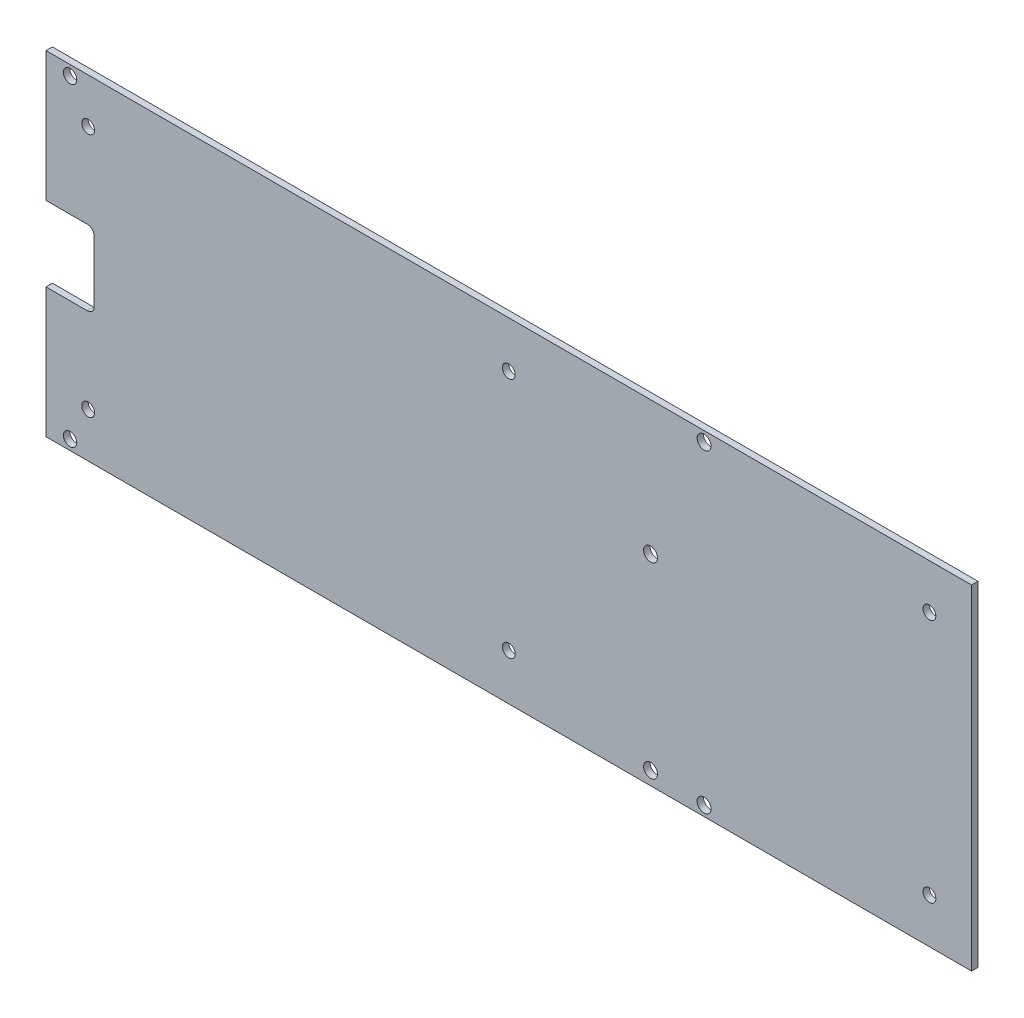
ISO-10303-21;
HEADER;
FILE_DESCRIPTION(('STEP AP214'),'2;1');
FILE_NAME('part.step','',(''),(''),'','','');
FILE_SCHEMA(('AUTOMOTIVE_DESIGN { 1 0 10303 214 1 1 1 1 }'));
ENDSEC;
DATA;
#1=APPLICATION_CONTEXT('core data for automotive mechanical design processes');
#2=APPLICATION_PROTOCOL_DEFINITION('international standard','automotive_design',2000,#1);
#3=PRODUCT_CONTEXT('',#1,'mechanical');
#4=PRODUCT('Part','Part','',(#3));
#5=PRODUCT_RELATED_PRODUCT_CATEGORY('part','',(#4));
#6=PRODUCT_DEFINITION_FORMATION('','',#4);
#7=PRODUCT_DEFINITION_CONTEXT('part definition',#1,'design');
#8=PRODUCT_DEFINITION('design','',#6,#7);
#9=PRODUCT_DEFINITION_SHAPE('','',#8);
#10=(LENGTH_UNIT() NAMED_UNIT(*) SI_UNIT(.MILLI.,.METRE.));
#11=(NAMED_UNIT(*) PLANE_ANGLE_UNIT() SI_UNIT($,.RADIAN.));
#12=(NAMED_UNIT(*) SI_UNIT($,.STERADIAN.) SOLID_ANGLE_UNIT());
#13=UNCERTAINTY_MEASURE_WITH_UNIT(LENGTH_MEASURE(1.E-05),#10,'distance_accuracy_value','');
#14=(GEOMETRIC_REPRESENTATION_CONTEXT(3) GLOBAL_UNCERTAINTY_ASSIGNED_CONTEXT((#13)) GLOBAL_UNIT_ASSIGNED_CONTEXT((#10,
#11,#12)) REPRESENTATION_CONTEXT('',''));
#15=CARTESIAN_POINT('',(0.,0.,0.));
#16=DIRECTION('',(0.,0.,1.));
#17=DIRECTION('',(1.,0.,0.));
#18=AXIS2_PLACEMENT_3D('',#15,#16,#17);
#19=CARTESIAN_POINT('',(0.,-3.05311331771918E-13,1.52400000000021));
#20=DIRECTION('',(1.,0.,0.));
#21=DIRECTION('',(0.,0.,-0.999999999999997));
#22=AXIS2_PLACEMENT_3D('',#19,#20,#21);
#23=PLANE('',#22);
#24=DIRECTION('',(0.,-1.,0.));
#25=VECTOR('',#24,1.);
#26=CARTESIAN_POINT('',(0.,0.,0.));
#27=LINE('',#26,#25);
#28=CARTESIAN_POINT('',(-5.27355936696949E-13,79.3750000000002,1.94289029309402E-13));
#29=VERTEX_POINT('',#28);
#30=CARTESIAN_POINT('',(-1.94289029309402E-13,48.5775,2.91433543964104E-13));
#31=VERTEX_POINT('',#30);
#32=EDGE_CURVE('E131',#29,#31,#27,.T.);
#33=ORIENTED_EDGE('',*,*,#32,.T.);
#34=DIRECTION('',(0.,0.,0.999999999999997));
#35=VECTOR('',#34,1.);
#36=CARTESIAN_POINT('',(-1.94289029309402E-13,48.5775,-1.016));
#37=LINE('',#36,#35);
#38=CARTESIAN_POINT('',(-6.38378239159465E-13,48.5775,1.52400000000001));
#39=VERTEX_POINT('',#38);
#40=EDGE_CURVE('E118',#31,#39,#37,.T.);
#41=ORIENTED_EDGE('',*,*,#40,.T.);
#42=DIRECTION('',(0.,-1.,0.));
#43=VECTOR('',#42,1.);
#44=CARTESIAN_POINT('',(0.,-3.05311331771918E-13,1.52400000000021));
#45=LINE('',#44,#43);
#46=CARTESIAN_POINT('',(-5.27355936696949E-13,79.3750000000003,1.52400000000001));
#47=VERTEX_POINT('',#46);
#48=EDGE_CURVE('E129',#47,#39,#45,.T.);
#49=ORIENTED_EDGE('',*,*,#48,.F.);
#50=DIRECTION('',(0.,0.,-0.999999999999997));
#51=VECTOR('',#50,1.);
#52=CARTESIAN_POINT('',(-5.27355936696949E-13,79.3750000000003,1.52400000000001));
#53=LINE('',#52,#51);
#54=EDGE_CURVE('E146',#47,#29,#53,.T.);
#55=ORIENTED_EDGE('',*,*,#54,.T.);
#56=EDGE_LOOP('',(#33,#41,#49,#55));
#57=FACE_BOUND('',#56,.T.);
#58=ADVANCED_FACE('F30',(#57),#23,.F.);
#59=CARTESIAN_POINT('',(0.,30.7975,1.52400000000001));
#60=VERTEX_POINT('',#59);
#61=CARTESIAN_POINT('',(0.,-3.05311331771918E-13,1.52400000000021));
#62=VERTEX_POINT('',#61);
#63=EDGE_CURVE('E82',#60,#62,#45,.T.);
#64=ORIENTED_EDGE('',*,*,#63,.F.);
#65=DIRECTION('',(0.,0.,0.999999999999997));
#66=VECTOR('',#65,1.);
#67=CARTESIAN_POINT('',(0.,30.7975000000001,-1.01599999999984));
#68=LINE('',#67,#66);
#69=CARTESIAN_POINT('',(0.,30.7975000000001,0.));
#70=VERTEX_POINT('',#69);
#71=EDGE_CURVE('E132',#70,#60,#68,.T.);
#72=ORIENTED_EDGE('',*,*,#71,.F.);
#73=CARTESIAN_POINT('',(0.,0.,0.));
#74=VERTEX_POINT('',#73);
#75=EDGE_CURVE('E149',#70,#74,#27,.T.);
#76=ORIENTED_EDGE('',*,*,#75,.T.);
#77=DIRECTION('',(0.,0.,-0.999999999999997));
#78=VECTOR('',#77,1.);
#79=CARTESIAN_POINT('',(0.,-3.05311331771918E-13,1.52400000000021));
#80=LINE('',#79,#78);
#81=EDGE_CURVE('E160',#62,#74,#80,.T.);
#82=ORIENTED_EDGE('',*,*,#81,.F.);
#83=EDGE_LOOP('',(#64,#72,#76,#82));
#84=FACE_BOUND('',#83,.T.);
#85=ADVANCED_FACE('F32',(#84),#23,.F.);
#86=CARTESIAN_POINT('',(0.,-3.05311331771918E-13,1.52400000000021));
#87=DIRECTION('',(0.,1.,0.));
#88=DIRECTION('',(0.,0.,0.999999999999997));
#89=AXIS2_PLACEMENT_3D('',#86,#87,#88);
#90=PLANE('',#89);
#91=DIRECTION('',(1.,0.,0.));
#92=VECTOR('',#91,1.);
#93=CARTESIAN_POINT('',(0.,0.,0.));
#94=LINE('',#93,#92);
#95=CARTESIAN_POINT('',(219.71,0.,0.));
#96=VERTEX_POINT('',#95);
#97=EDGE_CURVE('E148',#74,#96,#94,.T.);
#98=ORIENTED_EDGE('',*,*,#97,.T.);
#99=DIRECTION('',(0.,0.,-0.999999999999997));
#100=VECTOR('',#99,1.);
#101=CARTESIAN_POINT('',(219.71,-2.77555756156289E-13,1.52400000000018));
#102=LINE('',#101,#100);
#103=CARTESIAN_POINT('',(219.71,-2.77555756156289E-13,1.52400000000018));
#104=VERTEX_POINT('',#103);
#105=EDGE_CURVE('E157',#104,#96,#102,.T.);
#106=ORIENTED_EDGE('',*,*,#105,.F.);
#107=DIRECTION('',(1.,0.,0.));
#108=VECTOR('',#107,1.);
#109=CARTESIAN_POINT('',(0.,-3.05311331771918E-13,1.52400000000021));
#110=LINE('',#109,#108);
#111=EDGE_CURVE('E136',#62,#104,#110,.T.);
#112=ORIENTED_EDGE('',*,*,#111,.F.);
#113=ORIENTED_EDGE('',*,*,#81,.T.);
#114=EDGE_LOOP('',(#98,#106,#112,#113));
#115=FACE_BOUND('',#114,.T.);
#116=ADVANCED_FACE('F290',(#115),#90,.F.);
#117=CARTESIAN_POINT('',(219.71,-2.77555756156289E-13,1.52400000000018));
#118=DIRECTION('',(-1.,0.,0.));
#119=DIRECTION('',(0.,0.,0.999999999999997));
#120=AXIS2_PLACEMENT_3D('',#117,#118,#119);
#121=PLANE('',#120);
#122=DIRECTION('',(0.,1.,0.));
#123=VECTOR('',#122,1.);
#124=CARTESIAN_POINT('',(219.71,0.,0.));
#125=LINE('',#124,#123);
#126=CARTESIAN_POINT('',(219.71,79.375,0.));
#127=VERTEX_POINT('',#126);
#128=EDGE_CURVE('E151',#96,#127,#125,.T.);
#129=ORIENTED_EDGE('',*,*,#128,.T.);
#130=DIRECTION('',(0.,0.,-0.999999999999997));
#131=VECTOR('',#130,1.);
#132=CARTESIAN_POINT('',(219.71,79.3750000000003,1.52400000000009));
#133=LINE('',#132,#131);
#134=CARTESIAN_POINT('',(219.71,79.3750000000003,1.52400000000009));
#135=VERTEX_POINT('',#134);
#136=EDGE_CURVE('E155',#135,#127,#133,.T.);
#137=ORIENTED_EDGE('',*,*,#136,.F.);
#138=DIRECTION('',(0.,1.,0.));
#139=VECTOR('',#138,1.);
#140=CARTESIAN_POINT('',(219.71,-2.77555756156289E-13,1.52400000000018));
#141=LINE('',#140,#139);
#142=EDGE_CURVE('E138',#104,#135,#141,.T.);
#143=ORIENTED_EDGE('',*,*,#142,.F.);
#144=ORIENTED_EDGE('',*,*,#105,.T.);
#145=EDGE_LOOP('',(#129,#137,#143,#144));
#146=FACE_BOUND('',#145,.T.);
#147=ADVANCED_FACE('F281',(#146),#121,.F.);
#148=CARTESIAN_POINT('',(-5.27355936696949E-13,79.3750000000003,1.52400000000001));
#149=DIRECTION('',(0.,-1.,0.));
#150=DIRECTION('',(0.,0.,-0.999999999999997));
#151=AXIS2_PLACEMENT_3D('',#148,#149,#150);
#152=PLANE('',#151);
#153=DIRECTION('',(-1.,0.,0.));
#154=VECTOR('',#153,1.);
#155=CARTESIAN_POINT('',(-5.27355936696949E-13,79.3750000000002,1.94289029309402E-13));
#156=LINE('',#155,#154);
#157=EDGE_CURVE('E75',#127,#29,#156,.T.);
#158=ORIENTED_EDGE('',*,*,#157,.T.);
#159=ORIENTED_EDGE('',*,*,#54,.F.);
#160=DIRECTION('',(-1.,0.,0.));
#161=VECTOR('',#160,1.);
#162=CARTESIAN_POINT('',(-5.27355936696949E-13,79.3750000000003,1.52400000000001));
#163=LINE('',#162,#161);
#164=EDGE_CURVE('E54',#135,#47,#163,.T.);
#165=ORIENTED_EDGE('',*,*,#164,.F.);
#166=ORIENTED_EDGE('',*,*,#136,.T.);
#167=EDGE_LOOP('',(#158,#159,#165,#166));
#168=FACE_BOUND('',#167,.T.);
#169=ADVANCED_FACE('F273',(#168),#152,.F.);
#170=CARTESIAN_POINT('',(-5.27355936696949E-13,79.3750000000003,1.52400000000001));
#171=DIRECTION('',(0.,0.,-0.999999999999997));
#172=DIRECTION('',(-1.,0.,0.));
#173=AXIS2_PLACEMENT_3D('',#170,#171,#172);
#174=PLANE('',#173);
#175=CARTESIAN_POINT('',(143.51,3.17499999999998,1.52400000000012));
#176=DIRECTION('',(0.,0.,0.999999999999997));
#177=DIRECTION('',(1.,0.,0.));
#178=AXIS2_PLACEMENT_3D('',#175,#176,#177);
#179=CIRCLE('',#178,1.65100000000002);
#180=CARTESIAN_POINT('',(145.161,3.17499999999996,1.52400000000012));
#181=VERTEX_POINT('',#180);
#182=EDGE_CURVE('E202',#181,#181,#179,.T.);
#183=ORIENTED_EDGE('',*,*,#182,.F.);
#184=EDGE_LOOP('',(#183));
#185=FACE_BOUND('',#184,.T.);
#186=CARTESIAN_POINT('',(143.51,47.6249999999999,1.52400000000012));
#187=DIRECTION('',(0.,0.,0.999999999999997));
#188=DIRECTION('',(1.,0.,0.));
#189=AXIS2_PLACEMENT_3D('',#186,#187,#188);
#190=CIRCLE('',#189,1.65100000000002);
#191=CARTESIAN_POINT('',(145.161,47.625,1.52400000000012));
#192=VERTEX_POINT('',#191);
#193=EDGE_CURVE('E201',#192,#192,#190,.T.);
#194=ORIENTED_EDGE('',*,*,#193,.F.);
#195=EDGE_LOOP('',(#194));
#196=FACE_BOUND('',#195,.T.);
#197=CARTESIAN_POINT('',(5.71500000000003,2.38124999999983,1.52400000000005));
#198=DIRECTION('',(0.,0.,0.999999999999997));
#199=DIRECTION('',(1.,0.,0.));
#200=AXIS2_PLACEMENT_3D('',#197,#198,#199);
#201=CIRCLE('',#200,1.5875);
#202=CARTESIAN_POINT('',(7.30250000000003,2.38124999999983,1.52400000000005));
#203=VERTEX_POINT('',#202);
#204=EDGE_CURVE('E208',#203,#203,#201,.T.);
#205=ORIENTED_EDGE('',*,*,#204,.F.);
#206=EDGE_LOOP('',(#205));
#207=FACE_BOUND('',#206,.T.);
#208=CARTESIAN_POINT('',(5.7149999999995,76.9937500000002,1.52400000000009));
#209=DIRECTION('',(0.,0.,0.999999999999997));
#210=DIRECTION('',(1.,0.,0.));
#211=AXIS2_PLACEMENT_3D('',#208,#209,#210);
#212=CIRCLE('',#211,1.5875);
#213=CARTESIAN_POINT('',(7.3024999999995,76.9937500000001,1.52400000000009));
#214=VERTEX_POINT('',#213);
#215=EDGE_CURVE('E214',#214,#214,#212,.T.);
#216=ORIENTED_EDGE('',*,*,#215,.F.);
#217=EDGE_LOOP('',(#216));
#218=FACE_BOUND('',#217,.T.);
#219=CARTESIAN_POINT('',(156.21,2.38125,1.52400000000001));
#220=DIRECTION('',(0.,0.,0.999999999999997));
#221=DIRECTION('',(-1.,0.,0.));
#222=AXIS2_PLACEMENT_3D('',#219,#220,#221);
#223=CIRCLE('',#222,1.65100000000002);
#224=CARTESIAN_POINT('',(157.861,2.38125,1.52400000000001));
#225=VERTEX_POINT('',#224);
#226=EDGE_CURVE('E220',#225,#225,#223,.T.);
#227=ORIENTED_EDGE('',*,*,#226,.F.);
#228=EDGE_LOOP('',(#227));
#229=FACE_BOUND('',#228,.T.);
#230=CARTESIAN_POINT('',(10.0075999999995,68.7451,1.524));
#231=DIRECTION('',(0.,0.,0.999999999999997));
#232=DIRECTION('',(-1.,0.,0.));
#233=AXIS2_PLACEMENT_3D('',#230,#231,#232);
#234=CIRCLE('',#233,1.524);
#235=CARTESIAN_POINT('',(11.5315999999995,68.7450999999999,1.524));
#236=VERTEX_POINT('',#235);
#237=EDGE_CURVE('E226',#236,#236,#234,.T.);
#238=ORIENTED_EDGE('',*,*,#237,.F.);
#239=EDGE_LOOP('',(#238));
#240=FACE_BOUND('',#239,.T.);
#241=CARTESIAN_POINT('',(10.0076,10.6298999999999,1.52400000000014));
#242=DIRECTION('',(0.,0.,0.999999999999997));
#243=DIRECTION('',(1.,0.,0.));
#244=AXIS2_PLACEMENT_3D('',#241,#242,#243);
#245=CIRCLE('',#244,1.524);
#246=CARTESIAN_POINT('',(11.5316,10.6299,1.52400000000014));
#247=VERTEX_POINT('',#246);
#248=EDGE_CURVE('E232',#247,#247,#245,.T.);
#249=ORIENTED_EDGE('',*,*,#248,.F.);
#250=EDGE_LOOP('',(#249));
#251=FACE_BOUND('',#250,.T.);
#252=CARTESIAN_POINT('',(209.7024,10.6299,1.52400000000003));
#253=DIRECTION('',(0.,0.,0.999999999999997));
#254=DIRECTION('',(-1.,0.,0.));
#255=AXIS2_PLACEMENT_3D('',#252,#253,#254);
#256=CIRCLE('',#255,1.52400000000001);
#257=CARTESIAN_POINT('',(211.2264,10.6299,1.52400000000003));
#258=VERTEX_POINT('',#257);
#259=EDGE_CURVE('E238',#258,#258,#256,.T.);
#260=ORIENTED_EDGE('',*,*,#259,.F.);
#261=EDGE_LOOP('',(#260));
#262=FACE_BOUND('',#261,.T.);
#263=CARTESIAN_POINT('',(109.855,10.9855,1.52400000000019));
#264=DIRECTION('',(0.,0.,0.999999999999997));
#265=DIRECTION('',(-1.,0.,0.));
#266=AXIS2_PLACEMENT_3D('',#263,#264,#265);
#267=CIRCLE('',#266,1.52399999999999);
#268=CARTESIAN_POINT('',(111.379,10.9855,1.52400000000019));
#269=VERTEX_POINT('',#268);
#270=EDGE_CURVE('E244',#269,#269,#267,.T.);
#271=ORIENTED_EDGE('',*,*,#270,.F.);
#272=EDGE_LOOP('',(#271));
#273=FACE_BOUND('',#272,.T.);
#274=CARTESIAN_POINT('',(109.855,68.3895000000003,1.52400000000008));
#275=DIRECTION('',(0.,0.,0.999999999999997));
#276=DIRECTION('',(1.,0.,0.));
#277=AXIS2_PLACEMENT_3D('',#274,#275,#276);
#278=CIRCLE('',#277,1.52399999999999);
#279=CARTESIAN_POINT('',(111.379,68.3895,1.52400000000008));
#280=VERTEX_POINT('',#279);
#281=EDGE_CURVE('E250',#280,#280,#278,.T.);
#282=ORIENTED_EDGE('',*,*,#281,.F.);
#283=EDGE_LOOP('',(#282));
#284=FACE_BOUND('',#283,.T.);
#285=CARTESIAN_POINT('',(156.21,76.9937500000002,1.52400000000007));
#286=DIRECTION('',(0.,0.,0.999999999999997));
#287=DIRECTION('',(1.,0.,0.));
#288=AXIS2_PLACEMENT_3D('',#285,#286,#287);
#289=CIRCLE('',#288,1.65100000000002);
#290=CARTESIAN_POINT('',(157.861,76.9937500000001,1.52400000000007));
#291=VERTEX_POINT('',#290);
#292=EDGE_CURVE('E256',#291,#291,#289,.T.);
#293=ORIENTED_EDGE('',*,*,#292,.F.);
#294=EDGE_LOOP('',(#293));
#295=FACE_BOUND('',#294,.T.);
#296=CARTESIAN_POINT('',(209.7024,68.7450999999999,1.52400000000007));
#297=DIRECTION('',(0.,0.,0.999999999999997));
#298=DIRECTION('',(1.,0.,0.));
#299=AXIS2_PLACEMENT_3D('',#296,#297,#298);
#300=CIRCLE('',#299,1.52400000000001);
#301=CARTESIAN_POINT('',(211.2264,68.7450999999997,1.52400000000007));
#302=VERTEX_POINT('',#301);
#303=EDGE_CURVE('E141',#302,#302,#300,.T.);
#304=ORIENTED_EDGE('',*,*,#303,.F.);
#305=EDGE_LOOP('',(#304));
#306=FACE_BOUND('',#305,.T.);
#307=ORIENTED_EDGE('',*,*,#48,.T.);
#308=DIRECTION('',(-1.,0.,0.));
#309=VECTOR('',#308,1.);
#310=CARTESIAN_POINT('',(-6.38378239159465E-13,48.5775,1.52400000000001));
#311=LINE('',#310,#309);
#312=CARTESIAN_POINT('',(9.84249999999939,48.5775,1.524));
#313=VERTEX_POINT('',#312);
#314=EDGE_CURVE('E115',#313,#39,#311,.T.);
#315=ORIENTED_EDGE('',*,*,#314,.F.);
#316=CARTESIAN_POINT('',(9.84249999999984,46.99,1.524));
#317=DIRECTION('',(0.,0.,0.999999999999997));
#318=DIRECTION('',(-1.,0.,0.));
#319=AXIS2_PLACEMENT_3D('',#316,#317,#318);
#320=CIRCLE('',#319,1.5875);
#321=CARTESIAN_POINT('',(11.4299999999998,46.9900000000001,1.52400000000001));
#322=VERTEX_POINT('',#321);
#323=EDGE_CURVE('E133',#322,#313,#320,.T.);
#324=ORIENTED_EDGE('',*,*,#323,.F.);
#325=DIRECTION('',(0.,1.,0.));
#326=VECTOR('',#325,1.);
#327=CARTESIAN_POINT('',(11.4299999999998,46.9900000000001,1.52400000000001));
#328=LINE('',#327,#326);
#329=CARTESIAN_POINT('',(11.43,32.385,1.52400000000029));
#330=VERTEX_POINT('',#329);
#331=EDGE_CURVE('E180',#330,#322,#328,.T.);
#332=ORIENTED_EDGE('',*,*,#331,.F.);
#333=CARTESIAN_POINT('',(9.84250000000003,32.385,1.52400000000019));
#334=DIRECTION('',(0.,0.,0.999999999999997));
#335=DIRECTION('',(1.,0.,0.));
#336=AXIS2_PLACEMENT_3D('',#333,#334,#335);
#337=CIRCLE('',#336,1.5875);
#338=CARTESIAN_POINT('',(9.84250000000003,30.7975,1.52400000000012));
#339=VERTEX_POINT('',#338);
#340=EDGE_CURVE('E192',#339,#330,#337,.T.);
#341=ORIENTED_EDGE('',*,*,#340,.F.);
#342=DIRECTION('',(1.,0.,0.));
#343=VECTOR('',#342,1.);
#344=CARTESIAN_POINT('',(0.,30.7975,1.52400000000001));
#345=LINE('',#344,#343);
#346=EDGE_CURVE('E124',#60,#339,#345,.T.);
#347=ORIENTED_EDGE('',*,*,#346,.F.);
#348=ORIENTED_EDGE('',*,*,#63,.T.);
#349=ORIENTED_EDGE('',*,*,#111,.T.);
#350=ORIENTED_EDGE('',*,*,#142,.T.);
#351=ORIENTED_EDGE('',*,*,#164,.T.);
#352=EDGE_LOOP('',(#307,#315,#324,#332,#341,#347,#348,#349,#350,#351));
#353=FACE_BOUND('',#352,.T.);
#354=ADVANCED_FACE('F135',(#185,#196,#207,#218,#229,#240,#251,#262,#273,#284,#295,#306,#353),
#174,.F.);
#355=CARTESIAN_POINT('',(-5.27355936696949E-13,79.3750000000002,1.94289029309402E-13));
#356=DIRECTION('',(0.,0.,-0.999999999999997));
#357=DIRECTION('',(-1.,0.,0.));
#358=AXIS2_PLACEMENT_3D('',#355,#356,#357);
#359=PLANE('',#358);
#360=DIRECTION('',(1.,0.,0.));
#361=VECTOR('',#360,1.);
#362=CARTESIAN_POINT('',(-1.94289029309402E-13,48.5775,2.91433543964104E-13));
#363=LINE('',#362,#361);
#364=CARTESIAN_POINT('',(9.84249999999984,48.5775,1.80411241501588E-13));
#365=VERTEX_POINT('',#364);
#366=EDGE_CURVE('E11',#31,#365,#363,.T.);
#367=ORIENTED_EDGE('',*,*,#366,.F.);
#368=ORIENTED_EDGE('',*,*,#32,.F.);
#369=ORIENTED_EDGE('',*,*,#157,.F.);
#370=ORIENTED_EDGE('',*,*,#128,.F.);
#371=ORIENTED_EDGE('',*,*,#97,.F.);
#372=ORIENTED_EDGE('',*,*,#75,.F.);
#373=DIRECTION('',(-1.,0.,0.));
#374=VECTOR('',#373,1.);
#375=CARTESIAN_POINT('',(0.,30.7975000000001,0.));
#376=LINE('',#375,#374);
#377=CARTESIAN_POINT('',(9.84250000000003,30.7975000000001,0.));
#378=VERTEX_POINT('',#377);
#379=EDGE_CURVE('E163',#378,#70,#376,.T.);
#380=ORIENTED_EDGE('',*,*,#379,.F.);
#381=CARTESIAN_POINT('',(9.84250000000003,32.3850000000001,0.));
#382=DIRECTION('',(0.,0.,-0.999999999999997));
#383=DIRECTION('',(-1.,0.,0.));
#384=AXIS2_PLACEMENT_3D('',#381,#382,#383);
#385=CIRCLE('',#384,1.5875);
#386=CARTESIAN_POINT('',(11.43,32.385,0.));
#387=VERTEX_POINT('',#386);
#388=EDGE_CURVE('E165',#387,#378,#385,.T.);
#389=ORIENTED_EDGE('',*,*,#388,.F.);
#390=DIRECTION('',(0.,-1.,0.));
#391=VECTOR('',#390,1.);
#392=CARTESIAN_POINT('',(11.4299999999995,79.3750000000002,2.08166817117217E-13));
#393=LINE('',#392,#391);
#394=CARTESIAN_POINT('',(11.4299999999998,46.99,2.35922392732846E-13));
#395=VERTEX_POINT('',#394);
#396=EDGE_CURVE('E167',#395,#387,#393,.T.);
#397=ORIENTED_EDGE('',*,*,#396,.F.);
#398=CARTESIAN_POINT('',(9.84249999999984,46.99,1.52655665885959E-13));
#399=DIRECTION('',(0.,0.,-0.999999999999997));
#400=DIRECTION('',(-1.,0.,0.));
#401=AXIS2_PLACEMENT_3D('',#398,#399,#400);
#402=CIRCLE('',#401,1.5875);
#403=EDGE_CURVE('E38',#365,#395,#402,.T.);
#404=ORIENTED_EDGE('',*,*,#403,.F.);
#405=EDGE_LOOP('',(#367,#368,#369,#370,#371,#372,#380,#389,#397,#404));
#406=FACE_BOUND('',#405,.T.);
#407=CARTESIAN_POINT('',(143.51,3.17499999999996,0.));
#408=DIRECTION('',(0.,0.,0.999999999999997));
#409=DIRECTION('',(1.,0.,0.));
#410=AXIS2_PLACEMENT_3D('',#407,#408,#409);
#411=CIRCLE('',#410,1.65100000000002);
#412=CARTESIAN_POINT('',(145.161,3.17499999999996,0.));
#413=VERTEX_POINT('',#412);
#414=EDGE_CURVE('E198',#413,#413,#411,.T.);
#415=ORIENTED_EDGE('',*,*,#414,.T.);
#416=EDGE_LOOP('',(#415));
#417=FACE_BOUND('',#416,.T.);
#418=CARTESIAN_POINT('',(143.51,47.625,0.));
#419=DIRECTION('',(0.,0.,0.999999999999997));
#420=DIRECTION('',(1.,0.,0.));
#421=AXIS2_PLACEMENT_3D('',#418,#419,#420);
#422=CIRCLE('',#421,1.65100000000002);
#423=CARTESIAN_POINT('',(145.161,47.625,0.));
#424=VERTEX_POINT('',#423);
#425=EDGE_CURVE('E205',#424,#424,#422,.T.);
#426=ORIENTED_EDGE('',*,*,#425,.T.);
#427=EDGE_LOOP('',(#426));
#428=FACE_BOUND('',#427,.T.);
#429=CARTESIAN_POINT('',(5.71500000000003,2.38124999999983,2.35922392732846E-13));
#430=DIRECTION('',(0.,0.,0.999999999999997));
#431=DIRECTION('',(1.,0.,0.));
#432=AXIS2_PLACEMENT_3D('',#429,#430,#431);
#433=CIRCLE('',#432,1.5875);
#434=CARTESIAN_POINT('',(7.30250000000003,2.38124999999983,2.35896630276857E-13));
#435=VERTEX_POINT('',#434);
#436=EDGE_CURVE('E211',#435,#435,#433,.T.);
#437=ORIENTED_EDGE('',*,*,#436,.T.);
#438=EDGE_LOOP('',(#437));
#439=FACE_BOUND('',#438,.T.);
#440=CARTESIAN_POINT('',(5.7149999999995,76.9937500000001,1.80411241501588E-13));
#441=DIRECTION('',(0.,0.,0.999999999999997));
#442=DIRECTION('',(1.,0.,0.));
#443=AXIS2_PLACEMENT_3D('',#440,#441,#442);
#444=CIRCLE('',#443,1.5875);
#445=CARTESIAN_POINT('',(7.3024999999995,76.9937500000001,1.80385479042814E-13));
#446=VERTEX_POINT('',#445);
#447=EDGE_CURVE('E217',#446,#446,#444,.T.);
#448=ORIENTED_EDGE('',*,*,#447,.T.);
#449=EDGE_LOOP('',(#448));
#450=FACE_BOUND('',#449,.T.);
#451=CARTESIAN_POINT('',(156.21,2.38125,0.));
#452=DIRECTION('',(0.,0.,0.999999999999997));
#453=DIRECTION('',(-1.,0.,0.));
#454=AXIS2_PLACEMENT_3D('',#451,#452,#453);
#455=CIRCLE('',#454,1.65100000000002);
#456=CARTESIAN_POINT('',(157.861,2.38125,0.));
#457=VERTEX_POINT('',#456);
#458=EDGE_CURVE('E223',#457,#457,#455,.T.);
#459=ORIENTED_EDGE('',*,*,#458,.T.);
#460=EDGE_LOOP('',(#459));
#461=FACE_BOUND('',#460,.T.);
#462=CARTESIAN_POINT('',(10.0075999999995,68.7450999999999,2.22044604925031E-13));
#463=DIRECTION('',(0.,0.,0.999999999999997));
#464=DIRECTION('',(-1.,0.,0.));
#465=AXIS2_PLACEMENT_3D('',#462,#463,#464);
#466=CIRCLE('',#465,1.524);
#467=CARTESIAN_POINT('',(11.5315999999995,68.7450999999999,2.22019872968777E-13));
#468=VERTEX_POINT('',#467);
#469=EDGE_CURVE('E229',#468,#468,#466,.T.);
#470=ORIENTED_EDGE('',*,*,#469,.T.);
#471=EDGE_LOOP('',(#470));
#472=FACE_BOUND('',#471,.T.);
#473=CARTESIAN_POINT('',(10.0076,10.6299,0.));
#474=DIRECTION('',(0.,0.,0.999999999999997));
#475=DIRECTION('',(1.,0.,0.));
#476=AXIS2_PLACEMENT_3D('',#473,#474,#475);
#477=CIRCLE('',#476,1.524);
#478=CARTESIAN_POINT('',(11.5316,10.6299,0.));
#479=VERTEX_POINT('',#478);
#480=EDGE_CURVE('E235',#479,#479,#477,.T.);
#481=ORIENTED_EDGE('',*,*,#480,.T.);
#482=EDGE_LOOP('',(#481));
#483=FACE_BOUND('',#482,.T.);
#484=CARTESIAN_POINT('',(209.7024,10.6299,0.));
#485=DIRECTION('',(0.,0.,0.999999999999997));
#486=DIRECTION('',(-1.,0.,0.));
#487=AXIS2_PLACEMENT_3D('',#484,#485,#486);
#488=CIRCLE('',#487,1.52400000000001);
#489=CARTESIAN_POINT('',(211.2264,10.6299,0.));
#490=VERTEX_POINT('',#489);
#491=EDGE_CURVE('E241',#490,#490,#488,.T.);
#492=ORIENTED_EDGE('',*,*,#491,.T.);
#493=EDGE_LOOP('',(#492));
#494=FACE_BOUND('',#493,.T.);
#495=CARTESIAN_POINT('',(109.855,10.9855,0.));
#496=DIRECTION('',(0.,0.,0.999999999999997));
#497=DIRECTION('',(-1.,0.,0.));
#498=AXIS2_PLACEMENT_3D('',#495,#496,#497);
#499=CIRCLE('',#498,1.52399999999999);
#500=CARTESIAN_POINT('',(111.379,10.9855,0.));
#501=VERTEX_POINT('',#500);
#502=EDGE_CURVE('E247',#501,#501,#499,.T.);
#503=ORIENTED_EDGE('',*,*,#502,.T.);
#504=EDGE_LOOP('',(#503));
#505=FACE_BOUND('',#504,.T.);
#506=CARTESIAN_POINT('',(109.855,68.3895,1.94289029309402E-13));
#507=DIRECTION('',(0.,0.,0.999999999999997));
#508=DIRECTION('',(1.,0.,0.));
#509=AXIS2_PLACEMENT_3D('',#506,#507,#508);
#510=CIRCLE('',#509,1.52399999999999);
#511=CARTESIAN_POINT('',(111.379,68.3895,1.94264297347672E-13));
#512=VERTEX_POINT('',#511);
#513=EDGE_CURVE('E253',#512,#512,#510,.T.);
#514=ORIENTED_EDGE('',*,*,#513,.T.);
#515=EDGE_LOOP('',(#514));
#516=FACE_BOUND('',#515,.T.);
#517=CARTESIAN_POINT('',(156.21,76.9937500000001,1.66533453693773E-13));
#518=DIRECTION('',(0.,0.,0.999999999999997));
#519=DIRECTION('',(1.,0.,0.));
#520=AXIS2_PLACEMENT_3D('',#517,#518,#519);
#521=CIRCLE('',#520,1.65100000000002);
#522=CARTESIAN_POINT('',(157.861,76.9937500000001,1.66506660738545E-13));
#523=VERTEX_POINT('',#522);
#524=EDGE_CURVE('E259',#523,#523,#521,.T.);
#525=ORIENTED_EDGE('',*,*,#524,.T.);
#526=EDGE_LOOP('',(#525));
#527=FACE_BOUND('',#526,.T.);
#528=CARTESIAN_POINT('',(209.7024,68.7450999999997,1.80411241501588E-13));
#529=DIRECTION('',(0.,0.,0.999999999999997));
#530=DIRECTION('',(1.,0.,0.));
#531=AXIS2_PLACEMENT_3D('',#528,#529,#530);
#532=CIRCLE('',#531,1.52400000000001);
#533=CARTESIAN_POINT('',(211.2264,68.7450999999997,1.80386509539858E-13));
#534=VERTEX_POINT('',#533);
#535=EDGE_CURVE('E263',#534,#534,#532,.T.);
#536=ORIENTED_EDGE('',*,*,#535,.T.);
#537=EDGE_LOOP('',(#536));
#538=FACE_BOUND('',#537,.T.);
#539=ADVANCED_FACE('F184',(#406,#417,#428,#439,#450,#461,#472,#483,#494,#505,#516,#527,#538),
#359,.T.);
#540=CARTESIAN_POINT('',(209.7024,68.7450999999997,1.80411241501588E-13));
#541=DIRECTION('',(0.,0.,0.999999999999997));
#542=DIRECTION('',(1.,0.,0.));
#543=AXIS2_PLACEMENT_3D('',#540,#541,#542);
#544=CYLINDRICAL_SURFACE('',#543,1.52400000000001);
#545=CARTESIAN_POINT('',(211.2264,68.7450999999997,1.80386509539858E-13));
#546=CARTESIAN_POINT('',(211.2264,68.7450999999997,0.0158750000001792));
#547=CARTESIAN_POINT('',(211.2264,68.7450999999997,0.031750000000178));
#548=CARTESIAN_POINT('',(211.2264,68.7450999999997,0.0635000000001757));
#549=CARTESIAN_POINT('',(211.2264,68.7450999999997,0.0793750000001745));
#550=CARTESIAN_POINT('',(211.2264,68.7450999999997,0.111125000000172));
#551=CARTESIAN_POINT('',(211.2264,68.7450999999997,0.127000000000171));
#552=CARTESIAN_POINT('',(211.2264,68.7450999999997,0.158750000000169));
#553=CARTESIAN_POINT('',(211.2264,68.7450999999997,0.174625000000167));
#554=CARTESIAN_POINT('',(211.2264,68.7450999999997,0.206375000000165));
#555=CARTESIAN_POINT('',(211.2264,68.7450999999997,0.222250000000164));
#556=CARTESIAN_POINT('',(211.2264,68.7450999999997,0.254000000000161));
#557=CARTESIAN_POINT('',(211.2264,68.7450999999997,0.26987500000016));
#558=CARTESIAN_POINT('',(211.2264,68.7450999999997,0.301625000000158));
#559=CARTESIAN_POINT('',(211.2264,68.7450999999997,0.317500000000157));
#560=CARTESIAN_POINT('',(211.2264,68.7450999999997,0.349250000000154));
#561=CARTESIAN_POINT('',(211.2264,68.7450999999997,0.365125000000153));
#562=CARTESIAN_POINT('',(211.2264,68.7450999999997,0.396875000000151));
#563=CARTESIAN_POINT('',(211.2264,68.7450999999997,0.41275000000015));
#564=CARTESIAN_POINT('',(211.2264,68.7450999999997,0.444500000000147));
#565=CARTESIAN_POINT('',(211.2264,68.7450999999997,0.460375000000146));
#566=CARTESIAN_POINT('',(211.2264,68.7450999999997,0.492125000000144));
#567=CARTESIAN_POINT('',(211.2264,68.7450999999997,0.508000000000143));
#568=CARTESIAN_POINT('',(211.2264,68.7450999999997,0.53975000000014));
#569=CARTESIAN_POINT('',(211.2264,68.7450999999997,0.555625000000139));
#570=CARTESIAN_POINT('',(211.2264,68.7450999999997,0.587375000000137));
#571=CARTESIAN_POINT('',(211.2264,68.7450999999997,0.603250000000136));
#572=CARTESIAN_POINT('',(211.2264,68.7450999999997,0.635000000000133));
#573=CARTESIAN_POINT('',(211.2264,68.7450999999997,0.650875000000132));
#574=CARTESIAN_POINT('',(211.2264,68.7450999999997,0.68262500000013));
#575=CARTESIAN_POINT('',(211.2264,68.7450999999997,0.698500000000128));
#576=CARTESIAN_POINT('',(211.2264,68.7450999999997,0.730250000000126));
#577=CARTESIAN_POINT('',(211.2264,68.7450999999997,0.746125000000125));
#578=CARTESIAN_POINT('',(211.2264,68.7450999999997,0.777875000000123));
#579=CARTESIAN_POINT('',(211.2264,68.7450999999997,0.793750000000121));
#580=CARTESIAN_POINT('',(211.2264,68.7450999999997,0.825500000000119));
#581=CARTESIAN_POINT('',(211.2264,68.7450999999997,0.841375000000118));
#582=CARTESIAN_POINT('',(211.2264,68.7450999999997,0.873125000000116));
#583=CARTESIAN_POINT('',(211.2264,68.7450999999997,0.889000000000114));
#584=CARTESIAN_POINT('',(211.2264,68.7450999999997,0.920750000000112));
#585=CARTESIAN_POINT('',(211.2264,68.7450999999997,0.936625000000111));
#586=CARTESIAN_POINT('',(211.2264,68.7450999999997,0.968375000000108));
#587=CARTESIAN_POINT('',(211.2264,68.7450999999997,0.984250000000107));
#588=CARTESIAN_POINT('',(211.2264,68.7450999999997,1.0160000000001));
#589=CARTESIAN_POINT('',(211.2264,68.7450999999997,1.0318750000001));
#590=CARTESIAN_POINT('',(211.2264,68.7450999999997,1.0636250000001));
#591=CARTESIAN_POINT('',(211.2264,68.7450999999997,1.0795000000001));
#592=CARTESIAN_POINT('',(211.2264,68.7450999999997,1.1112500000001));
#593=CARTESIAN_POINT('',(211.2264,68.7450999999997,1.1271250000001));
#594=CARTESIAN_POINT('',(211.2264,68.7450999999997,1.15887500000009));
#595=CARTESIAN_POINT('',(211.2264,68.7450999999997,1.17475000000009));
#596=CARTESIAN_POINT('',(211.2264,68.7450999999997,1.20650000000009));
#597=CARTESIAN_POINT('',(211.2264,68.7450999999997,1.22237500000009));
#598=CARTESIAN_POINT('',(211.2264,68.7450999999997,1.25412500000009));
#599=CARTESIAN_POINT('',(211.2264,68.7450999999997,1.27000000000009));
#600=CARTESIAN_POINT('',(211.2264,68.7450999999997,1.30175000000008));
#601=CARTESIAN_POINT('',(211.2264,68.7450999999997,1.31762500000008));
#602=CARTESIAN_POINT('',(211.2264,68.7450999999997,1.34937500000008));
#603=CARTESIAN_POINT('',(211.2264,68.7450999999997,1.36525000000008));
#604=CARTESIAN_POINT('',(211.2264,68.7450999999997,1.39700000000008));
#605=CARTESIAN_POINT('',(211.2264,68.7450999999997,1.41287500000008));
#606=CARTESIAN_POINT('',(211.2264,68.7450999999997,1.44462500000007));
#607=CARTESIAN_POINT('',(211.2264,68.7450999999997,1.46050000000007));
#608=CARTESIAN_POINT('',(211.2264,68.7450999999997,1.49225000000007));
#609=CARTESIAN_POINT('',(211.2264,68.7450999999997,1.50812500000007));
#610=CARTESIAN_POINT('',(211.2264,68.7450999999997,1.52400000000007));
#611=B_SPLINE_CURVE_WITH_KNOTS('',3,(#545,#546,#547,#548,#549,#550,#551,#552,#553,#554,#555,
#556,#557,#558,#559,#560,#561,#562,#563,#564,#565,#566,#567,#568,#569,#570,#571,#572,#573,#574,
#575,#576,#577,#578,#579,#580,#581,#582,#583,#584,#585,#586,#587,#588,#589,#590,#591,#592,#593,
#594,#595,#596,#597,#598,#599,#600,#601,#602,#603,#604,#605,#606,#607,#608,#609,#610),
.UNSPECIFIED.,.F.,.F.,(4,2,2,2,2,2,2,2,2,2,2,2,2,2,2,2,2,2,2,2,2,2,2,2,2,2,2,2,2,2,2,2,4),(0.,
0.0476249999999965,0.0952499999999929,0.142874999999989,0.190499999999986,0.238124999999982,
0.285749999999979,0.333374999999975,0.380999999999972,0.428624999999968,0.476249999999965,
0.523874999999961,0.571499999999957,0.619124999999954,0.66674999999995,0.714374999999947,
0.761999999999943,0.80962499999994,0.857249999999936,0.904874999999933,0.952499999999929,
1.00012499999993,1.04774999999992,1.09537499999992,1.14299999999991,1.19062499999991,
1.23824999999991,1.2858749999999,1.3334999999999,1.3811249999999,1.42874999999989,
1.47637499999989,1.52399999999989),.UNSPECIFIED.);
#612=EDGE_CURVE('BSEAM270',#534,#302,#611,.T.);
#613=ORIENTED_EDGE('',*,*,#535,.F.);
#614=ORIENTED_EDGE('',*,*,#303,.T.);
#615=ORIENTED_EDGE('',*,*,#612,.T.);
#616=ORIENTED_EDGE('',*,*,#612,.F.);
#617=EDGE_LOOP('',(#613,#615,#614,#616));
#618=FACE_BOUND('',#617,.T.);
#619=ADVANCED_FACE('F270',(#618),#544,.F.);
#620=CARTESIAN_POINT('',(156.21,76.9937500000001,1.66533453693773E-13));
#621=DIRECTION('',(0.,0.,0.999999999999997));
#622=DIRECTION('',(1.,0.,0.));
#623=AXIS2_PLACEMENT_3D('',#620,#621,#622);
#624=CYLINDRICAL_SURFACE('',#623,1.65100000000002);
#625=CARTESIAN_POINT('',(157.861,76.9937500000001,1.66506660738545E-13));
#626=CARTESIAN_POINT('',(157.861,76.9937500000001,0.0158750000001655));
#627=CARTESIAN_POINT('',(157.861,76.9937500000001,0.0317500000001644));
#628=CARTESIAN_POINT('',(157.861,76.9937500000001,0.0635000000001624));
#629=CARTESIAN_POINT('',(157.861,76.9937500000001,0.0793750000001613));
#630=CARTESIAN_POINT('',(157.861,76.9937500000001,0.111125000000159));
#631=CARTESIAN_POINT('',(157.861,76.9937500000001,0.127000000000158));
#632=CARTESIAN_POINT('',(157.861,76.9937500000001,0.158750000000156));
#633=CARTESIAN_POINT('',(157.861,76.9937500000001,0.174625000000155));
#634=CARTESIAN_POINT('',(157.861,76.9937500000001,0.206375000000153));
#635=CARTESIAN_POINT('',(157.861,76.9937500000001,0.222250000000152));
#636=CARTESIAN_POINT('',(157.861,76.9937500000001,0.25400000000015));
#637=CARTESIAN_POINT('',(157.861,76.9937500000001,0.269875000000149));
#638=CARTESIAN_POINT('',(157.861,76.9937500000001,0.301625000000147));
#639=CARTESIAN_POINT('',(157.861,76.9937500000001,0.317500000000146));
#640=CARTESIAN_POINT('',(157.861,76.9937500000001,0.349250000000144));
#641=CARTESIAN_POINT('',(157.861,76.9937500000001,0.365125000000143));
#642=CARTESIAN_POINT('',(157.861,76.9937500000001,0.396875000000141));
#643=CARTESIAN_POINT('',(157.861,76.9937500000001,0.41275000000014));
#644=CARTESIAN_POINT('',(157.861,76.9937500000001,0.444500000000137));
#645=CARTESIAN_POINT('',(157.861,76.9937500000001,0.460375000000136));
#646=CARTESIAN_POINT('',(157.861,76.9937500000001,0.492125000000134));
#647=CARTESIAN_POINT('',(157.861,76.9937500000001,0.508000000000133));
#648=CARTESIAN_POINT('',(157.861,76.9937500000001,0.539750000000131));
#649=CARTESIAN_POINT('',(157.861,76.9937500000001,0.55562500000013));
#650=CARTESIAN_POINT('',(157.861,76.9937500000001,0.587375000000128));
#651=CARTESIAN_POINT('',(157.861,76.9937500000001,0.603250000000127));
#652=CARTESIAN_POINT('',(157.861,76.9937500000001,0.635000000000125));
#653=CARTESIAN_POINT('',(157.861,76.9937500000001,0.650875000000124));
#654=CARTESIAN_POINT('',(157.861,76.9937500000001,0.682625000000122));
#655=CARTESIAN_POINT('',(157.861,76.9937500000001,0.698500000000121));
#656=CARTESIAN_POINT('',(157.861,76.9937500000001,0.730250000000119));
#657=CARTESIAN_POINT('',(157.861,76.9937500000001,0.746125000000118));
#658=CARTESIAN_POINT('',(157.861,76.9937500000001,0.777875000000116));
#659=CARTESIAN_POINT('',(157.861,76.9937500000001,0.793750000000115));
#660=CARTESIAN_POINT('',(157.861,76.9937500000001,0.825500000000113));
#661=CARTESIAN_POINT('',(157.861,76.9937500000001,0.841375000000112));
#662=CARTESIAN_POINT('',(157.861,76.9937500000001,0.87312500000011));
#663=CARTESIAN_POINT('',(157.861,76.9937500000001,0.889000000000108));
#664=CARTESIAN_POINT('',(157.861,76.9937500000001,0.920750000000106));
#665=CARTESIAN_POINT('',(157.861,76.9937500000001,0.936625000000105));
#666=CARTESIAN_POINT('',(157.861,76.9937500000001,0.968375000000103));
#667=CARTESIAN_POINT('',(157.861,76.9937500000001,0.984250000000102));
#668=CARTESIAN_POINT('',(157.861,76.9937500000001,1.0160000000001));
#669=CARTESIAN_POINT('',(157.861,76.9937500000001,1.0318750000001));
#670=CARTESIAN_POINT('',(157.861,76.9937500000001,1.0636250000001));
#671=CARTESIAN_POINT('',(157.861,76.9937500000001,1.0795000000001));
#672=CARTESIAN_POINT('',(157.861,76.9937500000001,1.11125000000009));
#673=CARTESIAN_POINT('',(157.861,76.9937500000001,1.12712500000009));
#674=CARTESIAN_POINT('',(157.861,76.9937500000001,1.15887500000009));
#675=CARTESIAN_POINT('',(157.861,76.9937500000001,1.17475000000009));
#676=CARTESIAN_POINT('',(157.861,76.9937500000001,1.20650000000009));
#677=CARTESIAN_POINT('',(157.861,76.9937500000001,1.22237500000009));
#678=CARTESIAN_POINT('',(157.861,76.9937500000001,1.25412500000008));
#679=CARTESIAN_POINT('',(157.861,76.9937500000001,1.27000000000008));
#680=CARTESIAN_POINT('',(157.861,76.9937500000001,1.30175000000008));
#681=CARTESIAN_POINT('',(157.861,76.9937500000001,1.31762500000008));
#682=CARTESIAN_POINT('',(157.861,76.9937500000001,1.34937500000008));
#683=CARTESIAN_POINT('',(157.861,76.9937500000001,1.36525000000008));
#684=CARTESIAN_POINT('',(157.861,76.9937500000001,1.39700000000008));
#685=CARTESIAN_POINT('',(157.861,76.9937500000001,1.41287500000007));
#686=CARTESIAN_POINT('',(157.861,76.9937500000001,1.44462500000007));
#687=CARTESIAN_POINT('',(157.861,76.9937500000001,1.46050000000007));
#688=CARTESIAN_POINT('',(157.861,76.9937500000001,1.49225000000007));
#689=CARTESIAN_POINT('',(157.861,76.9937500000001,1.50812500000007));
#690=CARTESIAN_POINT('',(157.861,76.9937500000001,1.52400000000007));
#691=B_SPLINE_CURVE_WITH_KNOTS('',3,(#625,#626,#627,#628,#629,#630,#631,#632,#633,#634,#635,
#636,#637,#638,#639,#640,#641,#642,#643,#644,#645,#646,#647,#648,#649,#650,#651,#652,#653,#654,
#655,#656,#657,#658,#659,#660,#661,#662,#663,#664,#665,#666,#667,#668,#669,#670,#671,#672,#673,
#674,#675,#676,#677,#678,#679,#680,#681,#682,#683,#684,#685,#686,#687,#688,#689,#690),
.UNSPECIFIED.,.F.,.F.,(4,2,2,2,2,2,2,2,2,2,2,2,2,2,2,2,2,2,2,2,2,2,2,2,2,2,2,2,2,2,2,2,4),(0.,
0.0476249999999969,0.0952499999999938,0.142874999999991,0.190499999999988,0.238124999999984,
0.285749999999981,0.333374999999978,0.380999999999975,0.428624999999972,0.476249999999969,
0.523874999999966,0.571499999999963,0.61912499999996,0.666749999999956,0.714374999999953,
0.76199999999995,0.809624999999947,0.857249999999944,0.904874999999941,0.952499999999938,
1.00012499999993,1.04774999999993,1.09537499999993,1.14299999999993,1.19062499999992,
1.23824999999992,1.28587499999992,1.33349999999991,1.38112499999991,1.42874999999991,
1.4763749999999,1.5239999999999),.UNSPECIFIED.);
#692=EDGE_CURVE('BSEAM327',#523,#291,#691,.T.);
#693=ORIENTED_EDGE('',*,*,#524,.F.);
#694=ORIENTED_EDGE('',*,*,#292,.T.);
#695=ORIENTED_EDGE('',*,*,#692,.T.);
#696=ORIENTED_EDGE('',*,*,#692,.F.);
#697=EDGE_LOOP('',(#693,#695,#694,#696));
#698=FACE_BOUND('',#697,.T.);
#699=ADVANCED_FACE('F327',(#698),#624,.F.);
#700=CARTESIAN_POINT('',(109.855,68.3895,1.94289029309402E-13));
#701=DIRECTION('',(0.,0.,0.999999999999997));
#702=DIRECTION('',(1.,0.,0.));
#703=AXIS2_PLACEMENT_3D('',#700,#701,#702);
#704=CYLINDRICAL_SURFACE('',#703,1.52399999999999);
#705=CARTESIAN_POINT('',(111.379,68.3895,1.94264297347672E-13));
#706=CARTESIAN_POINT('',(111.379,68.3895,0.0158750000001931));
#707=CARTESIAN_POINT('',(111.379,68.3895,0.0317500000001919));
#708=CARTESIAN_POINT('',(111.379,68.3895,0.0635000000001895));
#709=CARTESIAN_POINT('',(111.379,68.3895,0.0793750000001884));
#710=CARTESIAN_POINT('',(111.379,68.3895,0.111125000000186));
#711=CARTESIAN_POINT('',(111.379,68.3895,0.127000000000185));
#712=CARTESIAN_POINT('',(111.379,68.3895,0.158750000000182));
#713=CARTESIAN_POINT('',(111.379,68.3895,0.174625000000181));
#714=CARTESIAN_POINT('',(111.379,68.3895,0.206375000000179));
#715=CARTESIAN_POINT('',(111.379,68.3895,0.222250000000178));
#716=CARTESIAN_POINT('',(111.379,68.3895,0.254000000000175));
#717=CARTESIAN_POINT('',(111.379,68.3895,0.269875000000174));
#718=CARTESIAN_POINT('',(111.379,68.3895,0.301625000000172));
#719=CARTESIAN_POINT('',(111.379,68.3895,0.317500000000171));
#720=CARTESIAN_POINT('',(111.379,68.3895,0.349250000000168));
#721=CARTESIAN_POINT('',(111.379,68.3895,0.365125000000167));
#722=CARTESIAN_POINT('',(111.379,68.3895,0.396875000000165));
#723=CARTESIAN_POINT('',(111.379,68.3895,0.412750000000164));
#724=CARTESIAN_POINT('',(111.379,68.3895,0.444500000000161));
#725=CARTESIAN_POINT('',(111.379,68.3895,0.46037500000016));
#726=CARTESIAN_POINT('',(111.379,68.3895,0.492125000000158));
#727=CARTESIAN_POINT('',(111.379,68.3895,0.508000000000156));
#728=CARTESIAN_POINT('',(111.379,68.3895,0.539750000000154));
#729=CARTESIAN_POINT('',(111.379,68.3895,0.555625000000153));
#730=CARTESIAN_POINT('',(111.379,68.3895,0.587375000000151));
#731=CARTESIAN_POINT('',(111.379,68.3895,0.603250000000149));
#732=CARTESIAN_POINT('',(111.379,68.3895,0.635000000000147));
#733=CARTESIAN_POINT('',(111.379,68.3895,0.650875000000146));
#734=CARTESIAN_POINT('',(111.379,68.3895,0.682625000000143));
#735=CARTESIAN_POINT('',(111.379,68.3895,0.698500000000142));
#736=CARTESIAN_POINT('',(111.379,68.3895,0.73025000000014));
#737=CARTESIAN_POINT('',(111.379,68.3895,0.746125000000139));
#738=CARTESIAN_POINT('',(111.379,68.3895,0.777875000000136));
#739=CARTESIAN_POINT('',(111.379,68.3895,0.793750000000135));
#740=CARTESIAN_POINT('',(111.379,68.3895,0.825500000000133));
#741=CARTESIAN_POINT('',(111.379,68.3895,0.841375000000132));
#742=CARTESIAN_POINT('',(111.379,68.3895,0.873125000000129));
#743=CARTESIAN_POINT('',(111.379,68.3895,0.889000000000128));
#744=CARTESIAN_POINT('',(111.379,68.3895,0.920750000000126));
#745=CARTESIAN_POINT('',(111.379,68.3895,0.936625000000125));
#746=CARTESIAN_POINT('',(111.379,68.3895,0.968375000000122));
#747=CARTESIAN_POINT('',(111.379,68.3895,0.984250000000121));
#748=CARTESIAN_POINT('',(111.379,68.3895,1.01600000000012));
#749=CARTESIAN_POINT('',(111.379,68.3895,1.03187500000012));
#750=CARTESIAN_POINT('',(111.379,68.3895,1.06362500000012));
#751=CARTESIAN_POINT('',(111.379,68.3895,1.07950000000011));
#752=CARTESIAN_POINT('',(111.379,68.3895,1.11125000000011));
#753=CARTESIAN_POINT('',(111.379,68.3895,1.12712500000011));
#754=CARTESIAN_POINT('',(111.379,68.3895,1.15887500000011));
#755=CARTESIAN_POINT('',(111.379,68.3895,1.17475000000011));
#756=CARTESIAN_POINT('',(111.379,68.3895,1.2065000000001));
#757=CARTESIAN_POINT('',(111.379,68.3895,1.2223750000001));
#758=CARTESIAN_POINT('',(111.379,68.3895,1.2541250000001));
#759=CARTESIAN_POINT('',(111.379,68.3895,1.2700000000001));
#760=CARTESIAN_POINT('',(111.379,68.3895,1.3017500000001));
#761=CARTESIAN_POINT('',(111.379,68.3895,1.3176250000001));
#762=CARTESIAN_POINT('',(111.379,68.3895,1.34937500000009));
#763=CARTESIAN_POINT('',(111.379,68.3895,1.36525000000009));
#764=CARTESIAN_POINT('',(111.379,68.3895,1.39700000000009));
#765=CARTESIAN_POINT('',(111.379,68.3895,1.41287500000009));
#766=CARTESIAN_POINT('',(111.379,68.3895,1.44462500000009));
#767=CARTESIAN_POINT('',(111.379,68.3895,1.46050000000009));
#768=CARTESIAN_POINT('',(111.379,68.3895,1.49225000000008));
#769=CARTESIAN_POINT('',(111.379,68.3895,1.50812500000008));
#770=CARTESIAN_POINT('',(111.379,68.3895,1.52400000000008));
#771=B_SPLINE_CURVE_WITH_KNOTS('',3,(#705,#706,#707,#708,#709,#710,#711,#712,#713,#714,#715,
#716,#717,#718,#719,#720,#721,#722,#723,#724,#725,#726,#727,#728,#729,#730,#731,#732,#733,#734,
#735,#736,#737,#738,#739,#740,#741,#742,#743,#744,#745,#746,#747,#748,#749,#750,#751,#752,#753,
#754,#755,#756,#757,#758,#759,#760,#761,#762,#763,#764,#765,#766,#767,#768,#769,#770),
.UNSPECIFIED.,.F.,.F.,(4,2,2,2,2,2,2,2,2,2,2,2,2,2,2,2,2,2,2,2,2,2,2,2,2,2,2,2,2,2,2,2,4),(0.,
0.0476249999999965,0.0952499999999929,0.142874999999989,0.190499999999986,0.238124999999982,
0.285749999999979,0.333374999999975,0.380999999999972,0.428624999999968,0.476249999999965,
0.523874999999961,0.571499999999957,0.619124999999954,0.66674999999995,0.714374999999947,
0.761999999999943,0.80962499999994,0.857249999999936,0.904874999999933,0.952499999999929,
1.00012499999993,1.04774999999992,1.09537499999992,1.14299999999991,1.19062499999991,
1.23824999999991,1.2858749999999,1.3334999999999,1.3811249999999,1.42874999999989,
1.47637499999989,1.52399999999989),.UNSPECIFIED.);
#772=EDGE_CURVE('BSEAM334',#512,#280,#771,.T.);
#773=ORIENTED_EDGE('',*,*,#513,.F.);
#774=ORIENTED_EDGE('',*,*,#281,.T.);
#775=ORIENTED_EDGE('',*,*,#772,.T.);
#776=ORIENTED_EDGE('',*,*,#772,.F.);
#777=EDGE_LOOP('',(#773,#775,#774,#776));
#778=FACE_BOUND('',#777,.T.);
#779=ADVANCED_FACE('F334',(#778),#704,.F.);
#780=CARTESIAN_POINT('',(109.855,10.9855,0.));
#781=DIRECTION('',(0.,0.,0.999999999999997));
#782=DIRECTION('',(1.,0.,0.));
#783=AXIS2_PLACEMENT_3D('',#780,#781,#782);
#784=CYLINDRICAL_SURFACE('',#783,1.52399999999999);
#785=CARTESIAN_POINT('',(111.379,10.9855,0.));
#786=CARTESIAN_POINT('',(111.379,10.9855,0.0158750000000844));
#787=CARTESIAN_POINT('',(111.379,10.9855,0.0317500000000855));
#788=CARTESIAN_POINT('',(111.379,10.9855,0.0635000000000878));
#789=CARTESIAN_POINT('',(111.379,10.9855,0.0793750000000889));
#790=CARTESIAN_POINT('',(111.379,10.9855,0.111125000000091));
#791=CARTESIAN_POINT('',(111.379,10.9855,0.127000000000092));
#792=CARTESIAN_POINT('',(111.379,10.9855,0.158750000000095));
#793=CARTESIAN_POINT('',(111.379,10.9855,0.174625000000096));
#794=CARTESIAN_POINT('',(111.379,10.9855,0.206375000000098));
#795=CARTESIAN_POINT('',(111.379,10.9855,0.222250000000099));
#796=CARTESIAN_POINT('',(111.379,10.9855,0.254000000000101));
#797=CARTESIAN_POINT('',(111.379,10.9855,0.269875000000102));
#798=CARTESIAN_POINT('',(111.379,10.9855,0.301625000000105));
#799=CARTESIAN_POINT('',(111.379,10.9855,0.317500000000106));
#800=CARTESIAN_POINT('',(111.379,10.9855,0.349250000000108));
#801=CARTESIAN_POINT('',(111.379,10.9855,0.365125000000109));
#802=CARTESIAN_POINT('',(111.379,10.9855,0.396875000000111));
#803=CARTESIAN_POINT('',(111.379,10.9855,0.412750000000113));
#804=CARTESIAN_POINT('',(111.379,10.9855,0.444500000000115));
#805=CARTESIAN_POINT('',(111.379,10.9855,0.460375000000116));
#806=CARTESIAN_POINT('',(111.379,10.9855,0.492125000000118));
#807=CARTESIAN_POINT('',(111.379,10.9855,0.508000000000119));
#808=CARTESIAN_POINT('',(111.379,10.9855,0.539750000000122));
#809=CARTESIAN_POINT('',(111.379,10.9855,0.555625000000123));
#810=CARTESIAN_POINT('',(111.379,10.9855,0.587375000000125));
#811=CARTESIAN_POINT('',(111.379,10.9855,0.603250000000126));
#812=CARTESIAN_POINT('',(111.379,10.9855,0.635000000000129));
#813=CARTESIAN_POINT('',(111.379,10.9855,0.65087500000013));
#814=CARTESIAN_POINT('',(111.379,10.9855,0.682625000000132));
#815=CARTESIAN_POINT('',(111.379,10.9855,0.698500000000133));
#816=CARTESIAN_POINT('',(111.379,10.9855,0.730250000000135));
#817=CARTESIAN_POINT('',(111.379,10.9855,0.746125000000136));
#818=CARTESIAN_POINT('',(111.379,10.9855,0.777875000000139));
#819=CARTESIAN_POINT('',(111.379,10.9855,0.79375000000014));
#820=CARTESIAN_POINT('',(111.379,10.9855,0.825500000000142));
#821=CARTESIAN_POINT('',(111.379,10.9855,0.841375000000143));
#822=CARTESIAN_POINT('',(111.379,10.9855,0.873125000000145));
#823=CARTESIAN_POINT('',(111.379,10.9855,0.889000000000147));
#824=CARTESIAN_POINT('',(111.379,10.9855,0.920750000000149));
#825=CARTESIAN_POINT('',(111.379,10.9855,0.93662500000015));
#826=CARTESIAN_POINT('',(111.379,10.9855,0.968375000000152));
#827=CARTESIAN_POINT('',(111.379,10.9855,0.984250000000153));
#828=CARTESIAN_POINT('',(111.379,10.9855,1.01600000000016));
#829=CARTESIAN_POINT('',(111.379,10.9855,1.03187500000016));
#830=CARTESIAN_POINT('',(111.379,10.9855,1.06362500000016));
#831=CARTESIAN_POINT('',(111.379,10.9855,1.07950000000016));
#832=CARTESIAN_POINT('',(111.379,10.9855,1.11125000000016));
#833=CARTESIAN_POINT('',(111.379,10.9855,1.12712500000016));
#834=CARTESIAN_POINT('',(111.379,10.9855,1.15887500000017));
#835=CARTESIAN_POINT('',(111.379,10.9855,1.17475000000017));
#836=CARTESIAN_POINT('',(111.379,10.9855,1.20650000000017));
#837=CARTESIAN_POINT('',(111.379,10.9855,1.22237500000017));
#838=CARTESIAN_POINT('',(111.379,10.9855,1.25412500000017));
#839=CARTESIAN_POINT('',(111.379,10.9855,1.27000000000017));
#840=CARTESIAN_POINT('',(111.379,10.9855,1.30175000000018));
#841=CARTESIAN_POINT('',(111.379,10.9855,1.31762500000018));
#842=CARTESIAN_POINT('',(111.379,10.9855,1.34937500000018));
#843=CARTESIAN_POINT('',(111.379,10.9855,1.36525000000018));
#844=CARTESIAN_POINT('',(111.379,10.9855,1.39700000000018));
#845=CARTESIAN_POINT('',(111.379,10.9855,1.41287500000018));
#846=CARTESIAN_POINT('',(111.379,10.9855,1.44462500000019));
#847=CARTESIAN_POINT('',(111.379,10.9855,1.46050000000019));
#848=CARTESIAN_POINT('',(111.379,10.9855,1.49225000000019));
#849=CARTESIAN_POINT('',(111.379,10.9855,1.50812500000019));
#850=CARTESIAN_POINT('',(111.379,10.9855,1.52400000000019));
#851=B_SPLINE_CURVE_WITH_KNOTS('',3,(#785,#786,#787,#788,#789,#790,#791,#792,#793,#794,#795,
#796,#797,#798,#799,#800,#801,#802,#803,#804,#805,#806,#807,#808,#809,#810,#811,#812,#813,#814,
#815,#816,#817,#818,#819,#820,#821,#822,#823,#824,#825,#826,#827,#828,#829,#830,#831,#832,#833,
#834,#835,#836,#837,#838,#839,#840,#841,#842,#843,#844,#845,#846,#847,#848,#849,#850),
.UNSPECIFIED.,.F.,.F.,(4,2,2,2,2,2,2,2,2,2,2,2,2,2,2,2,2,2,2,2,2,2,2,2,2,2,2,2,2,2,2,2,4),(0.,
0.0476250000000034,0.0952500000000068,0.14287500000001,0.190500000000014,0.238125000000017,
0.28575000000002,0.333375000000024,0.381000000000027,0.428625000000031,0.476250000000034,
0.523875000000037,0.571500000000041,0.619125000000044,0.666750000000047,0.714375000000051,
0.762000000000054,0.809625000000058,0.857250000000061,0.904875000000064,0.952500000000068,
1.00012500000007,1.04775000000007,1.09537500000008,1.14300000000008,1.19062500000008,
1.23825000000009,1.28587500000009,1.33350000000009,1.3811250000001,1.4287500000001,
1.47637500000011,1.52400000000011),.UNSPECIFIED.);
#852=EDGE_CURVE('BSEAM342',#501,#269,#851,.T.);
#853=ORIENTED_EDGE('',*,*,#502,.F.);
#854=ORIENTED_EDGE('',*,*,#270,.T.);
#855=ORIENTED_EDGE('',*,*,#852,.T.);
#856=ORIENTED_EDGE('',*,*,#852,.F.);
#857=EDGE_LOOP('',(#853,#855,#854,#856));
#858=FACE_BOUND('',#857,.T.);
#859=ADVANCED_FACE('F342',(#858),#784,.F.);
#860=CARTESIAN_POINT('',(209.7024,10.6299,0.));
#861=DIRECTION('',(0.,0.,0.999999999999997));
#862=DIRECTION('',(1.,0.,0.));
#863=AXIS2_PLACEMENT_3D('',#860,#861,#862);
#864=CYLINDRICAL_SURFACE('',#863,1.52400000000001);
#865=CARTESIAN_POINT('',(211.2264,10.6299,0.));
#866=CARTESIAN_POINT('',(211.2264,10.6299,0.0158749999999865));
#867=CARTESIAN_POINT('',(211.2264,10.6299,0.0317499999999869));
#868=CARTESIAN_POINT('',(211.2264,10.6299,0.0634999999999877));
#869=CARTESIAN_POINT('',(211.2264,10.6299,0.0793749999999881));
#870=CARTESIAN_POINT('',(211.2264,10.6299,0.111124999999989));
#871=CARTESIAN_POINT('',(211.2264,10.6299,0.126999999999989));
#872=CARTESIAN_POINT('',(211.2264,10.6299,0.15874999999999));
#873=CARTESIAN_POINT('',(211.2264,10.6299,0.174624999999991));
#874=CARTESIAN_POINT('',(211.2264,10.6299,0.206374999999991));
#875=CARTESIAN_POINT('',(211.2264,10.6299,0.222249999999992));
#876=CARTESIAN_POINT('',(211.2264,10.6299,0.253999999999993));
#877=CARTESIAN_POINT('',(211.2264,10.6299,0.269874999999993));
#878=CARTESIAN_POINT('',(211.2264,10.6299,0.301624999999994));
#879=CARTESIAN_POINT('',(211.2264,10.6299,0.317499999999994));
#880=CARTESIAN_POINT('',(211.2264,10.6299,0.349249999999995));
#881=CARTESIAN_POINT('',(211.2264,10.6299,0.365124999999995));
#882=CARTESIAN_POINT('',(211.2264,10.6299,0.396874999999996));
#883=CARTESIAN_POINT('',(211.2264,10.6299,0.412749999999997));
#884=CARTESIAN_POINT('',(211.2264,10.6299,0.444499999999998));
#885=CARTESIAN_POINT('',(211.2264,10.6299,0.460374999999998));
#886=CARTESIAN_POINT('',(211.2264,10.6299,0.492124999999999));
#887=CARTESIAN_POINT('',(211.2264,10.6299,0.507999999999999));
#888=CARTESIAN_POINT('',(211.2264,10.6299,0.53975));
#889=CARTESIAN_POINT('',(211.2264,10.6299,0.555625));
#890=CARTESIAN_POINT('',(211.2264,10.6299,0.587375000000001));
#891=CARTESIAN_POINT('',(211.2264,10.6299,0.603250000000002));
#892=CARTESIAN_POINT('',(211.2264,10.6299,0.635000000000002));
#893=CARTESIAN_POINT('',(211.2264,10.6299,0.650875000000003));
#894=CARTESIAN_POINT('',(211.2264,10.6299,0.682625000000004));
#895=CARTESIAN_POINT('',(211.2264,10.6299,0.698500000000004));
#896=CARTESIAN_POINT('',(211.2264,10.6299,0.730250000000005));
#897=CARTESIAN_POINT('',(211.2264,10.6299,0.746125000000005));
#898=CARTESIAN_POINT('',(211.2264,10.6299,0.777875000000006));
#899=CARTESIAN_POINT('',(211.2264,10.6299,0.793750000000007));
#900=CARTESIAN_POINT('',(211.2264,10.6299,0.825500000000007));
#901=CARTESIAN_POINT('',(211.2264,10.6299,0.841375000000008));
#902=CARTESIAN_POINT('',(211.2264,10.6299,0.873125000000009));
#903=CARTESIAN_POINT('',(211.2264,10.6299,0.889000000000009));
#904=CARTESIAN_POINT('',(211.2264,10.6299,0.92075000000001));
#905=CARTESIAN_POINT('',(211.2264,10.6299,0.93662500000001));
#906=CARTESIAN_POINT('',(211.2264,10.6299,0.968375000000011));
#907=CARTESIAN_POINT('',(211.2264,10.6299,0.984250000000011));
#908=CARTESIAN_POINT('',(211.2264,10.6299,1.01600000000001));
#909=CARTESIAN_POINT('',(211.2264,10.6299,1.03187500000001));
#910=CARTESIAN_POINT('',(211.2264,10.6299,1.06362500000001));
#911=CARTESIAN_POINT('',(211.2264,10.6299,1.07950000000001));
#912=CARTESIAN_POINT('',(211.2264,10.6299,1.11125000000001));
#913=CARTESIAN_POINT('',(211.2264,10.6299,1.12712500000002));
#914=CARTESIAN_POINT('',(211.2264,10.6299,1.15887500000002));
#915=CARTESIAN_POINT('',(211.2264,10.6299,1.17475000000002));
#916=CARTESIAN_POINT('',(211.2264,10.6299,1.20650000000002));
#917=CARTESIAN_POINT('',(211.2264,10.6299,1.22237500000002));
#918=CARTESIAN_POINT('',(211.2264,10.6299,1.25412500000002));
#919=CARTESIAN_POINT('',(211.2264,10.6299,1.27000000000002));
#920=CARTESIAN_POINT('',(211.2264,10.6299,1.30175000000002));
#921=CARTESIAN_POINT('',(211.2264,10.6299,1.31762500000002));
#922=CARTESIAN_POINT('',(211.2264,10.6299,1.34937500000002));
#923=CARTESIAN_POINT('',(211.2264,10.6299,1.36525000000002));
#924=CARTESIAN_POINT('',(211.2264,10.6299,1.39700000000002));
#925=CARTESIAN_POINT('',(211.2264,10.6299,1.41287500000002));
#926=CARTESIAN_POINT('',(211.2264,10.6299,1.44462500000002));
#927=CARTESIAN_POINT('',(211.2264,10.6299,1.46050000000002));
#928=CARTESIAN_POINT('',(211.2264,10.6299,1.49225000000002));
#929=CARTESIAN_POINT('',(211.2264,10.6299,1.50812500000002));
#930=CARTESIAN_POINT('',(211.2264,10.6299,1.52400000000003));
#931=B_SPLINE_CURVE_WITH_KNOTS('',3,(#865,#866,#867,#868,#869,#870,#871,#872,#873,#874,#875,
#876,#877,#878,#879,#880,#881,#882,#883,#884,#885,#886,#887,#888,#889,#890,#891,#892,#893,#894,
#895,#896,#897,#898,#899,#900,#901,#902,#903,#904,#905,#906,#907,#908,#909,#910,#911,#912,#913,
#914,#915,#916,#917,#918,#919,#920,#921,#922,#923,#924,#925,#926,#927,#928,#929,#930),
.UNSPECIFIED.,.F.,.F.,(4,2,2,2,2,2,2,2,2,2,2,2,2,2,2,2,2,2,2,2,2,2,2,2,2,2,2,2,2,2,2,2,4),(0.,
0.0476250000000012,0.0952500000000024,0.142875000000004,0.190500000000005,0.238125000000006,
0.285750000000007,0.333375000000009,0.38100000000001,0.428625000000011,0.476250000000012,
0.523875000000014,0.571500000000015,0.619125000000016,0.666750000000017,0.714375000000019,
0.76200000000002,0.809625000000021,0.857250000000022,0.904875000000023,0.952500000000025,
1.00012500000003,1.04775000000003,1.09537500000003,1.14300000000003,1.19062500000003,
1.23825000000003,1.28587500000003,1.33350000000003,1.38112500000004,1.42875000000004,
1.47637500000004,1.52400000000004),.UNSPECIFIED.);
#932=EDGE_CURVE('BSEAM350',#490,#258,#931,.T.);
#933=ORIENTED_EDGE('',*,*,#491,.F.);
#934=ORIENTED_EDGE('',*,*,#259,.T.);
#935=ORIENTED_EDGE('',*,*,#932,.T.);
#936=ORIENTED_EDGE('',*,*,#932,.F.);
#937=EDGE_LOOP('',(#933,#935,#934,#936));
#938=FACE_BOUND('',#937,.T.);
#939=ADVANCED_FACE('F350',(#938),#864,.F.);
#940=CARTESIAN_POINT('',(10.0076,10.6299,0.));
#941=DIRECTION('',(0.,0.,0.999999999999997));
#942=DIRECTION('',(1.,0.,0.));
#943=AXIS2_PLACEMENT_3D('',#940,#941,#942);
#944=CYLINDRICAL_SURFACE('',#943,1.524);
#945=CARTESIAN_POINT('',(11.5316,10.6299,0.));
#946=CARTESIAN_POINT('',(11.5316,10.6299,0.0158750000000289));
#947=CARTESIAN_POINT('',(11.5316,10.6299,0.03175000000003));
#948=CARTESIAN_POINT('',(11.5316,10.6299,0.0635000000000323));
#949=CARTESIAN_POINT('',(11.5316,10.6299,0.0793750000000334));
#950=CARTESIAN_POINT('',(11.5316,10.6299,0.111125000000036));
#951=CARTESIAN_POINT('',(11.5316,10.6299,0.127000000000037));
#952=CARTESIAN_POINT('',(11.5316,10.6299,0.158750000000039));
#953=CARTESIAN_POINT('',(11.5316,10.6299,0.17462500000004));
#954=CARTESIAN_POINT('',(11.5316,10.6299,0.206375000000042));
#955=CARTESIAN_POINT('',(11.5316,10.6299,0.222250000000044));
#956=CARTESIAN_POINT('',(11.5316,10.6299,0.254000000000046));
#957=CARTESIAN_POINT('',(11.5316,10.6299,0.269875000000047));
#958=CARTESIAN_POINT('',(11.5316,10.6299,0.301625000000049));
#959=CARTESIAN_POINT('',(11.5316,10.6299,0.31750000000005));
#960=CARTESIAN_POINT('',(11.5316,10.6299,0.349250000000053));
#961=CARTESIAN_POINT('',(11.5316,10.6299,0.365125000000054));
#962=CARTESIAN_POINT('',(11.5316,10.6299,0.396875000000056));
#963=CARTESIAN_POINT('',(11.5316,10.6299,0.412750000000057));
#964=CARTESIAN_POINT('',(11.5316,10.6299,0.444500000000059));
#965=CARTESIAN_POINT('',(11.5316,10.6299,0.460375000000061));
#966=CARTESIAN_POINT('',(11.5316,10.6299,0.492125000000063));
#967=CARTESIAN_POINT('',(11.5316,10.6299,0.508000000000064));
#968=CARTESIAN_POINT('',(11.5316,10.6299,0.539750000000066));
#969=CARTESIAN_POINT('',(11.5316,10.6299,0.555625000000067));
#970=CARTESIAN_POINT('',(11.5316,10.6299,0.58737500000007));
#971=CARTESIAN_POINT('',(11.5316,10.6299,0.603250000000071));
#972=CARTESIAN_POINT('',(11.5316,10.6299,0.635000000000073));
#973=CARTESIAN_POINT('',(11.5316,10.6299,0.650875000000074));
#974=CARTESIAN_POINT('',(11.5316,10.6299,0.682625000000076));
#975=CARTESIAN_POINT('',(11.5316,10.6299,0.698500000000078));
#976=CARTESIAN_POINT('',(11.5316,10.6299,0.73025000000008));
#977=CARTESIAN_POINT('',(11.5316,10.6299,0.746125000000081));
#978=CARTESIAN_POINT('',(11.5316,10.6299,0.777875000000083));
#979=CARTESIAN_POINT('',(11.5316,10.6299,0.793750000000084));
#980=CARTESIAN_POINT('',(11.5316,10.6299,0.825500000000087));
#981=CARTESIAN_POINT('',(11.5316,10.6299,0.841375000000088));
#982=CARTESIAN_POINT('',(11.5316,10.6299,0.87312500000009));
#983=CARTESIAN_POINT('',(11.5316,10.6299,0.889000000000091));
#984=CARTESIAN_POINT('',(11.5316,10.6299,0.920750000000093));
#985=CARTESIAN_POINT('',(11.5316,10.6299,0.936625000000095));
#986=CARTESIAN_POINT('',(11.5316,10.6299,0.968375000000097));
#987=CARTESIAN_POINT('',(11.5316,10.6299,0.984250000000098));
#988=CARTESIAN_POINT('',(11.5316,10.6299,1.0160000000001));
#989=CARTESIAN_POINT('',(11.5316,10.6299,1.0318750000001));
#990=CARTESIAN_POINT('',(11.5316,10.6299,1.0636250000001));
#991=CARTESIAN_POINT('',(11.5316,10.6299,1.0795000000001));
#992=CARTESIAN_POINT('',(11.5316,10.6299,1.11125000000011));
#993=CARTESIAN_POINT('',(11.5316,10.6299,1.12712500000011));
#994=CARTESIAN_POINT('',(11.5316,10.6299,1.15887500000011));
#995=CARTESIAN_POINT('',(11.5316,10.6299,1.17475000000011));
#996=CARTESIAN_POINT('',(11.5316,10.6299,1.20650000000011));
#997=CARTESIAN_POINT('',(11.5316,10.6299,1.22237500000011));
#998=CARTESIAN_POINT('',(11.5316,10.6299,1.25412500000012));
#999=CARTESIAN_POINT('',(11.5316,10.6299,1.27000000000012));
#1000=CARTESIAN_POINT('',(11.5316,10.6299,1.30175000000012));
#1001=CARTESIAN_POINT('',(11.5316,10.6299,1.31762500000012));
#1002=CARTESIAN_POINT('',(11.5316,10.6299,1.34937500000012));
#1003=CARTESIAN_POINT('',(11.5316,10.6299,1.36525000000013));
#1004=CARTESIAN_POINT('',(11.5316,10.6299,1.39700000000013));
#1005=CARTESIAN_POINT('',(11.5316,10.6299,1.41287500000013));
#1006=CARTESIAN_POINT('',(11.5316,10.6299,1.44462500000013));
#1007=CARTESIAN_POINT('',(11.5316,10.6299,1.46050000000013));
#1008=CARTESIAN_POINT('',(11.5316,10.6299,1.49225000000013));
#1009=CARTESIAN_POINT('',(11.5316,10.6299,1.50812500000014));
#1010=CARTESIAN_POINT('',(11.5316,10.6299,1.52400000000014));
#1011=B_SPLINE_CURVE_WITH_KNOTS('',3,(#945,#946,#947,#948,#949,#950,#951,#952,#953,#954,#955,
#956,#957,#958,#959,#960,#961,#962,#963,#964,#965,#966,#967,#968,#969,#970,#971,#972,#973,#974,
#975,#976,#977,#978,#979,#980,#981,#982,#983,#984,#985,#986,#987,#988,#989,#990,#991,#992,#993,
#994,#995,#996,#997,#998,#999,#1000,#1001,#1002,#1003,#1004,#1005,#1006,#1007,#1008,#1009,
#1010),.UNSPECIFIED.,.F.,.F.,(4,2,2,2,2,2,2,2,2,2,2,2,2,2,2,2,2,2,2,2,2,2,2,2,2,2,2,2,2,2,2,2,
4),(0.,0.0476250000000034,0.0952500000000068,0.14287500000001,0.190500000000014,
0.238125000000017,0.28575000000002,0.333375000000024,0.381000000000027,0.428625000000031,
0.476250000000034,0.523875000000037,0.571500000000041,0.619125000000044,0.666750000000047,
0.714375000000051,0.762000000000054,0.809625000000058,0.857250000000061,0.904875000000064,
0.952500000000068,1.00012500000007,1.04775000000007,1.09537500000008,1.14300000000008,
1.19062500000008,1.23825000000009,1.28587500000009,1.33350000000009,1.3811250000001,
1.4287500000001,1.47637500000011,1.52400000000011),.UNSPECIFIED.);
#1012=EDGE_CURVE('BSEAM358',#479,#247,#1011,.T.);
#1013=ORIENTED_EDGE('',*,*,#480,.F.);
#1014=ORIENTED_EDGE('',*,*,#248,.T.);
#1015=ORIENTED_EDGE('',*,*,#1012,.T.);
#1016=ORIENTED_EDGE('',*,*,#1012,.F.);
#1017=EDGE_LOOP('',(#1013,#1015,#1014,#1016));
#1018=FACE_BOUND('',#1017,.T.);
#1019=ADVANCED_FACE('F358',(#1018),#944,.F.);
#1020=CARTESIAN_POINT('',(10.0075999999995,68.7450999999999,2.22044604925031E-13));
#1021=DIRECTION('',(0.,0.,0.999999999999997));
#1022=DIRECTION('',(1.,0.,0.));
#1023=AXIS2_PLACEMENT_3D('',#1020,#1021,#1022);
#1024=CYLINDRICAL_SURFACE('',#1023,1.524);
#1025=CARTESIAN_POINT('',(11.5315999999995,68.7450999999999,2.22019872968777E-13));
#1026=CARTESIAN_POINT('',(11.5315999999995,68.7450999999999,0.0158750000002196));
#1027=CARTESIAN_POINT('',(11.5315999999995,68.7450999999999,0.0317500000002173));
#1028=CARTESIAN_POINT('',(11.5315999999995,68.7450999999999,0.0635000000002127));
#1029=CARTESIAN_POINT('',(11.5315999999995,68.7450999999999,0.0793750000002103));
#1030=CARTESIAN_POINT('',(11.5315999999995,68.7450999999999,0.111125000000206));
#1031=CARTESIAN_POINT('',(11.5315999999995,68.7450999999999,0.127000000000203));
#1032=CARTESIAN_POINT('',(11.5315999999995,68.7450999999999,0.158750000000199));
#1033=CARTESIAN_POINT('',(11.5315999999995,68.7450999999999,0.174625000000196));
#1034=CARTESIAN_POINT('',(11.5315999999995,68.7450999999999,0.206375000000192));
#1035=CARTESIAN_POINT('',(11.5315999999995,68.7450999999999,0.222250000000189));
#1036=CARTESIAN_POINT('',(11.5315999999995,68.7450999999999,0.254000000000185));
#1037=CARTESIAN_POINT('',(11.5315999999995,68.7450999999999,0.269875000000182));
#1038=CARTESIAN_POINT('',(11.5315999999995,68.7450999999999,0.301625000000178));
#1039=CARTESIAN_POINT('',(11.5315999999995,68.7450999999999,0.317500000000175));
#1040=CARTESIAN_POINT('',(11.5315999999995,68.7450999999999,0.349250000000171));
#1041=CARTESIAN_POINT('',(11.5315999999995,68.7450999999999,0.365125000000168));
#1042=CARTESIAN_POINT('',(11.5315999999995,68.7450999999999,0.396875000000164));
#1043=CARTESIAN_POINT('',(11.5315999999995,68.7450999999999,0.412750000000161));
#1044=CARTESIAN_POINT('',(11.5315999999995,68.7450999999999,0.444500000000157));
#1045=CARTESIAN_POINT('',(11.5315999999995,68.7450999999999,0.460375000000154));
#1046=CARTESIAN_POINT('',(11.5315999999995,68.7450999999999,0.49212500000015));
#1047=CARTESIAN_POINT('',(11.5315999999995,68.7450999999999,0.508000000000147));
#1048=CARTESIAN_POINT('',(11.5315999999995,68.7450999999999,0.539750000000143));
#1049=CARTESIAN_POINT('',(11.5315999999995,68.7450999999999,0.55562500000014));
#1050=CARTESIAN_POINT('',(11.5315999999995,68.7450999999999,0.587375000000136));
#1051=CARTESIAN_POINT('',(11.5315999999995,68.7450999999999,0.603250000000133));
#1052=CARTESIAN_POINT('',(11.5315999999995,68.7450999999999,0.635000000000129));
#1053=CARTESIAN_POINT('',(11.5315999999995,68.7450999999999,0.650875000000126));
#1054=CARTESIAN_POINT('',(11.5315999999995,68.7450999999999,0.682625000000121));
#1055=CARTESIAN_POINT('',(11.5315999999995,68.7450999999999,0.698500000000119));
#1056=CARTESIAN_POINT('',(11.5315999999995,68.7450999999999,0.730250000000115));
#1057=CARTESIAN_POINT('',(11.5315999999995,68.7450999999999,0.746125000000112));
#1058=CARTESIAN_POINT('',(11.5315999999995,68.7450999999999,0.777875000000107));
#1059=CARTESIAN_POINT('',(11.5315999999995,68.7450999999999,0.793750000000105));
#1060=CARTESIAN_POINT('',(11.5315999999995,68.7450999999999,0.8255000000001));
#1061=CARTESIAN_POINT('',(11.5315999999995,68.7450999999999,0.841375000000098));
#1062=CARTESIAN_POINT('',(11.5315999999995,68.7450999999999,0.873125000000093));
#1063=CARTESIAN_POINT('',(11.5315999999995,68.7450999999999,0.889000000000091));
#1064=CARTESIAN_POINT('',(11.5315999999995,68.7450999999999,0.920750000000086));
#1065=CARTESIAN_POINT('',(11.5315999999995,68.7450999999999,0.936625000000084));
#1066=CARTESIAN_POINT('',(11.5315999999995,68.7450999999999,0.968375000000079));
#1067=CARTESIAN_POINT('',(11.5315999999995,68.7450999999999,0.984250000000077));
#1068=CARTESIAN_POINT('',(11.5315999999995,68.7450999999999,1.01600000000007));
#1069=CARTESIAN_POINT('',(11.5315999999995,68.7450999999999,1.03187500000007));
#1070=CARTESIAN_POINT('',(11.5315999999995,68.7450999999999,1.06362500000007));
#1071=CARTESIAN_POINT('',(11.5315999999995,68.7450999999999,1.07950000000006));
#1072=CARTESIAN_POINT('',(11.5315999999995,68.7450999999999,1.11125000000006));
#1073=CARTESIAN_POINT('',(11.5315999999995,68.7450999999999,1.12712500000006));
#1074=CARTESIAN_POINT('',(11.5315999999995,68.7450999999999,1.15887500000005));
#1075=CARTESIAN_POINT('',(11.5315999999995,68.7450999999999,1.17475000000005));
#1076=CARTESIAN_POINT('',(11.5315999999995,68.7450999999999,1.20650000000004));
#1077=CARTESIAN_POINT('',(11.5315999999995,68.7450999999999,1.22237500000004));
#1078=CARTESIAN_POINT('',(11.5315999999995,68.7450999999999,1.25412500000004));
#1079=CARTESIAN_POINT('',(11.5315999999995,68.7450999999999,1.27000000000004));
#1080=CARTESIAN_POINT('',(11.5315999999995,68.7450999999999,1.30175000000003));
#1081=CARTESIAN_POINT('',(11.5315999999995,68.7450999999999,1.31762500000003));
#1082=CARTESIAN_POINT('',(11.5315999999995,68.7450999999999,1.34937500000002));
#1083=CARTESIAN_POINT('',(11.5315999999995,68.7450999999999,1.36525000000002));
#1084=CARTESIAN_POINT('',(11.5315999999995,68.7450999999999,1.39700000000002));
#1085=CARTESIAN_POINT('',(11.5315999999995,68.7450999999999,1.41287500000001));
#1086=CARTESIAN_POINT('',(11.5315999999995,68.7450999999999,1.44462500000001));
#1087=CARTESIAN_POINT('',(11.5315999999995,68.7450999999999,1.46050000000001));
#1088=CARTESIAN_POINT('',(11.5315999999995,68.7450999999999,1.49225));
#1089=CARTESIAN_POINT('',(11.5315999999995,68.7450999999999,1.508125));
#1090=CARTESIAN_POINT('',(11.5315999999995,68.7450999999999,1.524));
#1091=B_SPLINE_CURVE_WITH_KNOTS('',3,(#1025,#1026,#1027,#1028,#1029,#1030,#1031,#1032,#1033,
#1034,#1035,#1036,#1037,#1038,#1039,#1040,#1041,#1042,#1043,#1044,#1045,#1046,#1047,#1048,#1049,
#1050,#1051,#1052,#1053,#1054,#1055,#1056,#1057,#1058,#1059,#1060,#1061,#1062,#1063,#1064,#1065,
#1066,#1067,#1068,#1069,#1070,#1071,#1072,#1073,#1074,#1075,#1076,#1077,#1078,#1079,#1080,#1081,
#1082,#1083,#1084,#1085,#1086,#1087,#1088,#1089,#1090),.UNSPECIFIED.,.F.,.F.,(4,2,2,2,2,2,2,2,2,
2,2,2,2,2,2,2,2,2,2,2,2,2,2,2,2,2,2,2,2,2,2,2,4),(0.,0.047624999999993,0.095249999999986,
0.142874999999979,0.190499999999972,0.238124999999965,0.285749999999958,0.333374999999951,
0.380999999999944,0.428624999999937,0.47624999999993,0.523874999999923,0.571499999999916,
0.619124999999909,0.666749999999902,0.714374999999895,0.761999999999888,0.809624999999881,
0.857249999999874,0.904874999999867,0.95249999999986,1.00012499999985,1.04774999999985,
1.09537499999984,1.14299999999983,1.19062499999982,1.23824999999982,1.28587499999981,
1.3334999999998,1.3811249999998,1.42874999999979,1.47637499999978,1.52399999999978),.UNSPECIFIED.);
#1092=EDGE_CURVE('BSEAM366',#468,#236,#1091,.T.);
#1093=ORIENTED_EDGE('',*,*,#469,.F.);
#1094=ORIENTED_EDGE('',*,*,#237,.T.);
#1095=ORIENTED_EDGE('',*,*,#1092,.T.);
#1096=ORIENTED_EDGE('',*,*,#1092,.F.);
#1097=EDGE_LOOP('',(#1093,#1095,#1094,#1096));
#1098=FACE_BOUND('',#1097,.T.);
#1099=ADVANCED_FACE('F366',(#1098),#1024,.F.);
#1100=CARTESIAN_POINT('',(156.21,2.38125,0.));
#1101=DIRECTION('',(0.,0.,0.999999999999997));
#1102=DIRECTION('',(1.,0.,0.));
#1103=AXIS2_PLACEMENT_3D('',#1100,#1101,#1102);
#1104=CYLINDRICAL_SURFACE('',#1103,1.65100000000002);
#1105=CARTESIAN_POINT('',(157.861,2.38125,0.));
#1106=CARTESIAN_POINT('',(157.861,2.38125,0.0158750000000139));
#1107=CARTESIAN_POINT('',(157.861,2.38125,0.0317500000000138));
#1108=CARTESIAN_POINT('',(157.861,2.38125,0.0635000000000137));
#1109=CARTESIAN_POINT('',(157.861,2.38125,0.0793750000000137));
#1110=CARTESIAN_POINT('',(157.861,2.38125,0.111125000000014));
#1111=CARTESIAN_POINT('',(157.861,2.38125,0.127000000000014));
#1112=CARTESIAN_POINT('',(157.861,2.38125,0.158750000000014));
#1113=CARTESIAN_POINT('',(157.861,2.38125,0.174625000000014));
#1114=CARTESIAN_POINT('',(157.861,2.38125,0.206375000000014));
#1115=CARTESIAN_POINT('',(157.861,2.38125,0.222250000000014));
#1116=CARTESIAN_POINT('',(157.861,2.38125,0.254000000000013));
#1117=CARTESIAN_POINT('',(157.861,2.38125,0.269875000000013));
#1118=CARTESIAN_POINT('',(157.861,2.38125,0.301625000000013));
#1119=CARTESIAN_POINT('',(157.861,2.38125,0.317500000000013));
#1120=CARTESIAN_POINT('',(157.861,2.38125,0.349250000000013));
#1121=CARTESIAN_POINT('',(157.861,2.38125,0.365125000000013));
#1122=CARTESIAN_POINT('',(157.861,2.38125,0.396875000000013));
#1123=CARTESIAN_POINT('',(157.861,2.38125,0.412750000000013));
#1124=CARTESIAN_POINT('',(157.861,2.38125,0.444500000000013));
#1125=CARTESIAN_POINT('',(157.861,2.38125,0.460375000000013));
#1126=CARTESIAN_POINT('',(157.861,2.38125,0.492125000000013));
#1127=CARTESIAN_POINT('',(157.861,2.38125,0.508000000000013));
#1128=CARTESIAN_POINT('',(157.861,2.38125,0.539750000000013));
#1129=CARTESIAN_POINT('',(157.861,2.38125,0.555625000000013));
#1130=CARTESIAN_POINT('',(157.861,2.38125,0.587375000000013));
#1131=CARTESIAN_POINT('',(157.861,2.38125,0.603250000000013));
#1132=CARTESIAN_POINT('',(157.861,2.38125,0.635000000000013));
#1133=CARTESIAN_POINT('',(157.861,2.38125,0.650875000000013));
#1134=CARTESIAN_POINT('',(157.861,2.38125,0.682625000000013));
#1135=CARTESIAN_POINT('',(157.861,2.38125,0.698500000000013));
#1136=CARTESIAN_POINT('',(157.861,2.38125,0.730250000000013));
#1137=CARTESIAN_POINT('',(157.861,2.38125,0.746125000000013));
#1138=CARTESIAN_POINT('',(157.861,2.38125,0.777875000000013));
#1139=CARTESIAN_POINT('',(157.861,2.38125,0.793750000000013));
#1140=CARTESIAN_POINT('',(157.861,2.38125,0.825500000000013));
#1141=CARTESIAN_POINT('',(157.861,2.38125,0.841375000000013));
#1142=CARTESIAN_POINT('',(157.861,2.38125,0.873125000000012));
#1143=CARTESIAN_POINT('',(157.861,2.38125,0.889000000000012));
#1144=CARTESIAN_POINT('',(157.861,2.38125,0.920750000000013));
#1145=CARTESIAN_POINT('',(157.861,2.38125,0.936625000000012));
#1146=CARTESIAN_POINT('',(157.861,2.38125,0.968375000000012));
#1147=CARTESIAN_POINT('',(157.861,2.38125,0.984250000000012));
#1148=CARTESIAN_POINT('',(157.861,2.38125,1.01600000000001));
#1149=CARTESIAN_POINT('',(157.861,2.38125,1.03187500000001));
#1150=CARTESIAN_POINT('',(157.861,2.38125,1.06362500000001));
#1151=CARTESIAN_POINT('',(157.861,2.38125,1.07950000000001));
#1152=CARTESIAN_POINT('',(157.861,2.38125,1.11125000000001));
#1153=CARTESIAN_POINT('',(157.861,2.38125,1.12712500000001));
#1154=CARTESIAN_POINT('',(157.861,2.38125,1.15887500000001));
#1155=CARTESIAN_POINT('',(157.861,2.38125,1.17475000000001));
#1156=CARTESIAN_POINT('',(157.861,2.38125,1.20650000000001));
#1157=CARTESIAN_POINT('',(157.861,2.38125,1.22237500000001));
#1158=CARTESIAN_POINT('',(157.861,2.38125,1.25412500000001));
#1159=CARTESIAN_POINT('',(157.861,2.38125,1.27000000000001));
#1160=CARTESIAN_POINT('',(157.861,2.38125,1.30175000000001));
#1161=CARTESIAN_POINT('',(157.861,2.38125,1.31762500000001));
#1162=CARTESIAN_POINT('',(157.861,2.38125,1.34937500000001));
#1163=CARTESIAN_POINT('',(157.861,2.38125,1.36525000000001));
#1164=CARTESIAN_POINT('',(157.861,2.38125,1.39700000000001));
#1165=CARTESIAN_POINT('',(157.861,2.38125,1.41287500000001));
#1166=CARTESIAN_POINT('',(157.861,2.38125,1.44462500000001));
#1167=CARTESIAN_POINT('',(157.861,2.38125,1.46050000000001));
#1168=CARTESIAN_POINT('',(157.861,2.38125,1.49225000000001));
#1169=CARTESIAN_POINT('',(157.861,2.38125,1.50812500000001));
#1170=CARTESIAN_POINT('',(157.861,2.38125,1.52400000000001));
#1171=B_SPLINE_CURVE_WITH_KNOTS('',3,(#1105,#1106,#1107,#1108,#1109,#1110,#1111,#1112,#1113,
#1114,#1115,#1116,#1117,#1118,#1119,#1120,#1121,#1122,#1123,#1124,#1125,#1126,#1127,#1128,#1129,
#1130,#1131,#1132,#1133,#1134,#1135,#1136,#1137,#1138,#1139,#1140,#1141,#1142,#1143,#1144,#1145,
#1146,#1147,#1148,#1149,#1150,#1151,#1152,#1153,#1154,#1155,#1156,#1157,#1158,#1159,#1160,#1161,
#1162,#1163,#1164,#1165,#1166,#1167,#1168,#1169,#1170),.UNSPECIFIED.,.F.,.F.,(4,2,2,2,2,2,2,2,2,
2,2,2,2,2,2,2,2,2,2,2,2,2,2,2,2,2,2,2,2,2,2,2,4),(0.,0.0476249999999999,0.0952499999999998,
0.142875,0.1905,0.238125,0.28575,0.333374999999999,0.380999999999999,0.428624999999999,
0.476249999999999,0.523874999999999,0.571499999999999,0.619124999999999,0.666749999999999,
0.714374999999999,0.761999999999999,0.809624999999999,0.857249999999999,0.904874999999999,
0.952499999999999,1.000125,1.04775,1.095375,1.143,1.190625,1.23825,1.285875,1.3335,1.381125,
1.42875,1.476375,1.524),.UNSPECIFIED.);
#1172=EDGE_CURVE('BSEAM374',#457,#225,#1171,.T.);
#1173=ORIENTED_EDGE('',*,*,#458,.F.);
#1174=ORIENTED_EDGE('',*,*,#226,.T.);
#1175=ORIENTED_EDGE('',*,*,#1172,.T.);
#1176=ORIENTED_EDGE('',*,*,#1172,.F.);
#1177=EDGE_LOOP('',(#1173,#1175,#1174,#1176));
#1178=FACE_BOUND('',#1177,.T.);
#1179=ADVANCED_FACE('F374',(#1178),#1104,.F.);
#1180=CARTESIAN_POINT('',(5.7149999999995,76.9937500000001,1.80411241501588E-13));
#1181=DIRECTION('',(0.,0.,0.999999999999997));
#1182=DIRECTION('',(1.,0.,0.));
#1183=AXIS2_PLACEMENT_3D('',#1180,#1181,#1182);
#1184=CYLINDRICAL_SURFACE('',#1183,1.5875);
#1185=CARTESIAN_POINT('',(7.3024999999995,76.9937500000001,1.80385479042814E-13));
#1186=CARTESIAN_POINT('',(7.3024999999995,76.9937500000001,0.0158750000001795));
#1187=CARTESIAN_POINT('',(7.3024999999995,76.9937500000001,0.0317500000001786));
#1188=CARTESIAN_POINT('',(7.3024999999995,76.9937500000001,0.0635000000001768));
#1189=CARTESIAN_POINT('',(7.3024999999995,76.9937500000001,0.0793750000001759));
#1190=CARTESIAN_POINT('',(7.3024999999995,76.9937500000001,0.111125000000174));
#1191=CARTESIAN_POINT('',(7.3024999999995,76.9937500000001,0.127000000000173));
#1192=CARTESIAN_POINT('',(7.3024999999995,76.9937500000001,0.158750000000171));
#1193=CARTESIAN_POINT('',(7.3024999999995,76.9937500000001,0.174625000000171));
#1194=CARTESIAN_POINT('',(7.3024999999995,76.9937500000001,0.206375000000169));
#1195=CARTESIAN_POINT('',(7.3024999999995,76.9937500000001,0.222250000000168));
#1196=CARTESIAN_POINT('',(7.3024999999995,76.9937500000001,0.254000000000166));
#1197=CARTESIAN_POINT('',(7.3024999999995,76.9937500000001,0.269875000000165));
#1198=CARTESIAN_POINT('',(7.3024999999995,76.9937500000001,0.301625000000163));
#1199=CARTESIAN_POINT('',(7.3024999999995,76.9937500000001,0.317500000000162));
#1200=CARTESIAN_POINT('',(7.3024999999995,76.9937500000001,0.349250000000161));
#1201=CARTESIAN_POINT('',(7.3024999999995,76.9937500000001,0.36512500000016));
#1202=CARTESIAN_POINT('',(7.3024999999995,76.9937500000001,0.396875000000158));
#1203=CARTESIAN_POINT('',(7.3024999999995,76.9937500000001,0.412750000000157));
#1204=CARTESIAN_POINT('',(7.3024999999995,76.9937500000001,0.444500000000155));
#1205=CARTESIAN_POINT('',(7.3024999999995,76.9937500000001,0.460375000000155));
#1206=CARTESIAN_POINT('',(7.3024999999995,76.9937500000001,0.492125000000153));
#1207=CARTESIAN_POINT('',(7.3024999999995,76.9937500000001,0.508000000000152));
#1208=CARTESIAN_POINT('',(7.3024999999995,76.9937500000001,0.53975000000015));
#1209=CARTESIAN_POINT('',(7.3024999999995,76.9937500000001,0.555625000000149));
#1210=CARTESIAN_POINT('',(7.3024999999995,76.9937500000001,0.587375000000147));
#1211=CARTESIAN_POINT('',(7.3024999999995,76.9937500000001,0.603250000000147));
#1212=CARTESIAN_POINT('',(7.3024999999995,76.9937500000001,0.635000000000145));
#1213=CARTESIAN_POINT('',(7.3024999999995,76.9937500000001,0.650875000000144));
#1214=CARTESIAN_POINT('',(7.3024999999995,76.9937500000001,0.682625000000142));
#1215=CARTESIAN_POINT('',(7.3024999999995,76.9937500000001,0.698500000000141));
#1216=CARTESIAN_POINT('',(7.3024999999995,76.9937500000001,0.730250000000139));
#1217=CARTESIAN_POINT('',(7.3024999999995,76.9937500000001,0.746125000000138));
#1218=CARTESIAN_POINT('',(7.3024999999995,76.9937500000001,0.777875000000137));
#1219=CARTESIAN_POINT('',(7.3024999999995,76.9937500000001,0.793750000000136));
#1220=CARTESIAN_POINT('',(7.3024999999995,76.9937500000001,0.825500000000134));
#1221=CARTESIAN_POINT('',(7.3024999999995,76.9937500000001,0.841375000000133));
#1222=CARTESIAN_POINT('',(7.3024999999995,76.9937500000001,0.873125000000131));
#1223=CARTESIAN_POINT('',(7.3024999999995,76.9937500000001,0.88900000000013));
#1224=CARTESIAN_POINT('',(7.3024999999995,76.9937500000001,0.920750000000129));
#1225=CARTESIAN_POINT('',(7.3024999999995,76.9937500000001,0.936625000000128));
#1226=CARTESIAN_POINT('',(7.3024999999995,76.9937500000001,0.968375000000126));
#1227=CARTESIAN_POINT('',(7.3024999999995,76.9937500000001,0.984250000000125));
#1228=CARTESIAN_POINT('',(7.3024999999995,76.9937500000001,1.01600000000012));
#1229=CARTESIAN_POINT('',(7.3024999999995,76.9937500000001,1.03187500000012));
#1230=CARTESIAN_POINT('',(7.3024999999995,76.9937500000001,1.06362500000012));
#1231=CARTESIAN_POINT('',(7.3024999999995,76.9937500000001,1.07950000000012));
#1232=CARTESIAN_POINT('',(7.3024999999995,76.9937500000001,1.11125000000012));
#1233=CARTESIAN_POINT('',(7.3024999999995,76.9937500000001,1.12712500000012));
#1234=CARTESIAN_POINT('',(7.3024999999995,76.9937500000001,1.15887500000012));
#1235=CARTESIAN_POINT('',(7.3024999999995,76.9937500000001,1.17475000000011));
#1236=CARTESIAN_POINT('',(7.3024999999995,76.9937500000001,1.20650000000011));
#1237=CARTESIAN_POINT('',(7.3024999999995,76.9937500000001,1.22237500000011));
#1238=CARTESIAN_POINT('',(7.3024999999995,76.9937500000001,1.25412500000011));
#1239=CARTESIAN_POINT('',(7.3024999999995,76.9937500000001,1.27000000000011));
#1240=CARTESIAN_POINT('',(7.3024999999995,76.9937500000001,1.30175000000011));
#1241=CARTESIAN_POINT('',(7.3024999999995,76.9937500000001,1.31762500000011));
#1242=CARTESIAN_POINT('',(7.3024999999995,76.9937500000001,1.3493750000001));
#1243=CARTESIAN_POINT('',(7.3024999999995,76.9937500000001,1.3652500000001));
#1244=CARTESIAN_POINT('',(7.3024999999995,76.9937500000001,1.3970000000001));
#1245=CARTESIAN_POINT('',(7.3024999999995,76.9937500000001,1.4128750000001));
#1246=CARTESIAN_POINT('',(7.3024999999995,76.9937500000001,1.4446250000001));
#1247=CARTESIAN_POINT('',(7.3024999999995,76.9937500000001,1.4605000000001));
#1248=CARTESIAN_POINT('',(7.3024999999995,76.9937500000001,1.4922500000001));
#1249=CARTESIAN_POINT('',(7.3024999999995,76.9937500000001,1.5081250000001));
#1250=CARTESIAN_POINT('',(7.3024999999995,76.9937500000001,1.52400000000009));
#1251=B_SPLINE_CURVE_WITH_KNOTS('',3,(#1185,#1186,#1187,#1188,#1189,#1190,#1191,#1192,#1193,
#1194,#1195,#1196,#1197,#1198,#1199,#1200,#1201,#1202,#1203,#1204,#1205,#1206,#1207,#1208,#1209,
#1210,#1211,#1212,#1213,#1214,#1215,#1216,#1217,#1218,#1219,#1220,#1221,#1222,#1223,#1224,#1225,
#1226,#1227,#1228,#1229,#1230,#1231,#1232,#1233,#1234,#1235,#1236,#1237,#1238,#1239,#1240,#1241,
#1242,#1243,#1244,#1245,#1246,#1247,#1248,#1249,#1250),.UNSPECIFIED.,.F.,.F.,(4,2,2,2,2,2,2,2,2,
2,2,2,2,2,2,2,2,2,2,2,2,2,2,2,2,2,2,2,2,2,2,2,4),(0.,0.0476249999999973,0.0952499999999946,
0.142874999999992,0.190499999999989,0.238124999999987,0.285749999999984,0.333374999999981,
0.380999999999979,0.428624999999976,0.476249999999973,0.523874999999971,0.571499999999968,
0.619124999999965,0.666749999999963,0.71437499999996,0.761999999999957,0.809624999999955,
0.857249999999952,0.904874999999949,0.952499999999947,1.00012499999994,1.04774999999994,
1.09537499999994,1.14299999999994,1.19062499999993,1.23824999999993,1.28587499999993,
1.33349999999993,1.38112499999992,1.42874999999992,1.47637499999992,1.52399999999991),.UNSPECIFIED.);
#1252=EDGE_CURVE('BSEAM382',#446,#214,#1251,.T.);
#1253=ORIENTED_EDGE('',*,*,#447,.F.);
#1254=ORIENTED_EDGE('',*,*,#215,.T.);
#1255=ORIENTED_EDGE('',*,*,#1252,.T.);
#1256=ORIENTED_EDGE('',*,*,#1252,.F.);
#1257=EDGE_LOOP('',(#1253,#1255,#1254,#1256));
#1258=FACE_BOUND('',#1257,.T.);
#1259=ADVANCED_FACE('F382',(#1258),#1184,.F.);
#1260=CARTESIAN_POINT('',(5.71500000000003,2.38124999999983,2.35922392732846E-13));
#1261=DIRECTION('',(0.,0.,0.999999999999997));
#1262=DIRECTION('',(1.,0.,0.));
#1263=AXIS2_PLACEMENT_3D('',#1260,#1261,#1262);
#1264=CYLINDRICAL_SURFACE('',#1263,1.5875);
#1265=CARTESIAN_POINT('',(7.30250000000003,2.38124999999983,2.35896630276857E-13));
#1266=CARTESIAN_POINT('',(7.30250000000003,2.38124999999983,0.015875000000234));
#1267=CARTESIAN_POINT('',(7.30250000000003,2.38124999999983,0.0317500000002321));
#1268=CARTESIAN_POINT('',(7.30250000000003,2.38124999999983,0.0635000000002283));
#1269=CARTESIAN_POINT('',(7.30250000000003,2.38124999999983,0.0793750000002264));
#1270=CARTESIAN_POINT('',(7.30250000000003,2.38124999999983,0.111125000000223));
#1271=CARTESIAN_POINT('',(7.30250000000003,2.38124999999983,0.127000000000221));
#1272=CARTESIAN_POINT('',(7.30250000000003,2.38124999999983,0.158750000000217));
#1273=CARTESIAN_POINT('',(7.30250000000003,2.38124999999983,0.174625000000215));
#1274=CARTESIAN_POINT('',(7.30250000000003,2.38124999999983,0.206375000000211));
#1275=CARTESIAN_POINT('',(7.30250000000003,2.38124999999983,0.222250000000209));
#1276=CARTESIAN_POINT('',(7.30250000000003,2.38124999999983,0.254000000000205));
#1277=CARTESIAN_POINT('',(7.30250000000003,2.38124999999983,0.269875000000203));
#1278=CARTESIAN_POINT('',(7.30250000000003,2.38124999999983,0.3016250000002));
#1279=CARTESIAN_POINT('',(7.30250000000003,2.38124999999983,0.317500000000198));
#1280=CARTESIAN_POINT('',(7.30250000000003,2.38124999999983,0.349250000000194));
#1281=CARTESIAN_POINT('',(7.30250000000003,2.38124999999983,0.365125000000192));
#1282=CARTESIAN_POINT('',(7.30250000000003,2.38124999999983,0.396875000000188));
#1283=CARTESIAN_POINT('',(7.30250000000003,2.38124999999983,0.412750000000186));
#1284=CARTESIAN_POINT('',(7.30250000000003,2.38124999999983,0.444500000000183));
#1285=CARTESIAN_POINT('',(7.30250000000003,2.38124999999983,0.460375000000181));
#1286=CARTESIAN_POINT('',(7.30250000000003,2.38124999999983,0.492125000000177));
#1287=CARTESIAN_POINT('',(7.30250000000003,2.38124999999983,0.508000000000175));
#1288=CARTESIAN_POINT('',(7.30250000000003,2.38124999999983,0.539750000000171));
#1289=CARTESIAN_POINT('',(7.30250000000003,2.38124999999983,0.555625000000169));
#1290=CARTESIAN_POINT('',(7.30250000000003,2.38124999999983,0.587375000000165));
#1291=CARTESIAN_POINT('',(7.30250000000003,2.38124999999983,0.603250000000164));
#1292=CARTESIAN_POINT('',(7.30250000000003,2.38124999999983,0.63500000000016));
#1293=CARTESIAN_POINT('',(7.30250000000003,2.38124999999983,0.650875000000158));
#1294=CARTESIAN_POINT('',(7.30250000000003,2.38124999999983,0.682625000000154));
#1295=CARTESIAN_POINT('',(7.30250000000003,2.38124999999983,0.698500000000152));
#1296=CARTESIAN_POINT('',(7.30250000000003,2.38124999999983,0.730250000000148));
#1297=CARTESIAN_POINT('',(7.30250000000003,2.38124999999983,0.746125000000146));
#1298=CARTESIAN_POINT('',(7.30250000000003,2.38124999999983,0.777875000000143));
#1299=CARTESIAN_POINT('',(7.30250000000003,2.38124999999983,0.793750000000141));
#1300=CARTESIAN_POINT('',(7.30250000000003,2.38124999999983,0.825500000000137));
#1301=CARTESIAN_POINT('',(7.30250000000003,2.38124999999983,0.841375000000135));
#1302=CARTESIAN_POINT('',(7.30250000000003,2.38124999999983,0.873125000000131));
#1303=CARTESIAN_POINT('',(7.30250000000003,2.38124999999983,0.889000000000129));
#1304=CARTESIAN_POINT('',(7.30250000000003,2.38124999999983,0.920750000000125));
#1305=CARTESIAN_POINT('',(7.30250000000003,2.38124999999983,0.936625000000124));
#1306=CARTESIAN_POINT('',(7.30250000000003,2.38124999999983,0.96837500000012));
#1307=CARTESIAN_POINT('',(7.30250000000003,2.38124999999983,0.984250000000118));
#1308=CARTESIAN_POINT('',(7.30250000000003,2.38124999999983,1.01600000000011));
#1309=CARTESIAN_POINT('',(7.30250000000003,2.38124999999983,1.03187500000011));
#1310=CARTESIAN_POINT('',(7.30250000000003,2.38124999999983,1.06362500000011));
#1311=CARTESIAN_POINT('',(7.30250000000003,2.38124999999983,1.07950000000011));
#1312=CARTESIAN_POINT('',(7.30250000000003,2.38124999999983,1.1112500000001));
#1313=CARTESIAN_POINT('',(7.30250000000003,2.38124999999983,1.1271250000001));
#1314=CARTESIAN_POINT('',(7.30250000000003,2.38124999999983,1.1588750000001));
#1315=CARTESIAN_POINT('',(7.30250000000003,2.38124999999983,1.17475000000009));
#1316=CARTESIAN_POINT('',(7.30250000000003,2.38124999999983,1.20650000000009));
#1317=CARTESIAN_POINT('',(7.30250000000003,2.38124999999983,1.22237500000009));
#1318=CARTESIAN_POINT('',(7.30250000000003,2.38124999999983,1.25412500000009));
#1319=CARTESIAN_POINT('',(7.30250000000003,2.38124999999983,1.27000000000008));
#1320=CARTESIAN_POINT('',(7.30250000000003,2.38124999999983,1.30175000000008));
#1321=CARTESIAN_POINT('',(7.30250000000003,2.38124999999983,1.31762500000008));
#1322=CARTESIAN_POINT('',(7.30250000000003,2.38124999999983,1.34937500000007));
#1323=CARTESIAN_POINT('',(7.30250000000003,2.38124999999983,1.36525000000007));
#1324=CARTESIAN_POINT('',(7.30250000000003,2.38124999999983,1.39700000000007));
#1325=CARTESIAN_POINT('',(7.30250000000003,2.38124999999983,1.41287500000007));
#1326=CARTESIAN_POINT('',(7.30250000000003,2.38124999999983,1.44462500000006));
#1327=CARTESIAN_POINT('',(7.30250000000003,2.38124999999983,1.46050000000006));
#1328=CARTESIAN_POINT('',(7.30250000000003,2.38124999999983,1.49225000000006));
#1329=CARTESIAN_POINT('',(7.30250000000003,2.38124999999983,1.50812500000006));
#1330=CARTESIAN_POINT('',(7.30250000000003,2.38124999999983,1.52400000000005));
#1331=B_SPLINE_CURVE_WITH_KNOTS('',3,(#1265,#1266,#1267,#1268,#1269,#1270,#1271,#1272,#1273,
#1274,#1275,#1276,#1277,#1278,#1279,#1280,#1281,#1282,#1283,#1284,#1285,#1286,#1287,#1288,#1289,
#1290,#1291,#1292,#1293,#1294,#1295,#1296,#1297,#1298,#1299,#1300,#1301,#1302,#1303,#1304,#1305,
#1306,#1307,#1308,#1309,#1310,#1311,#1312,#1313,#1314,#1315,#1316,#1317,#1318,#1319,#1320,#1321,
#1322,#1323,#1324,#1325,#1326,#1327,#1328,#1329,#1330),.UNSPECIFIED.,.F.,.F.,(4,2,2,2,2,2,2,2,2,
2,2,2,2,2,2,2,2,2,2,2,2,2,2,2,2,2,2,2,2,2,2,2,4),(0.,0.0476249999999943,0.0952499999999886,
0.142874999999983,0.190499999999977,0.238124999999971,0.285749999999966,0.33337499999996,
0.380999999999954,0.428624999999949,0.476249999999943,0.523874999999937,0.571499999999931,
0.619124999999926,0.66674999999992,0.714374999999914,0.761999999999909,0.809624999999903,
0.857249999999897,0.904874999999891,0.952499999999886,1.00012499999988,1.04774999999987,
1.09537499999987,1.14299999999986,1.19062499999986,1.23824999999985,1.28587499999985,
1.33349999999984,1.38112499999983,1.42874999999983,1.47637499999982,1.52399999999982),.UNSPECIFIED.);
#1332=EDGE_CURVE('BSEAM390',#435,#203,#1331,.T.);
#1333=ORIENTED_EDGE('',*,*,#436,.F.);
#1334=ORIENTED_EDGE('',*,*,#204,.T.);
#1335=ORIENTED_EDGE('',*,*,#1332,.T.);
#1336=ORIENTED_EDGE('',*,*,#1332,.F.);
#1337=EDGE_LOOP('',(#1333,#1335,#1334,#1336));
#1338=FACE_BOUND('',#1337,.T.);
#1339=ADVANCED_FACE('F390',(#1338),#1264,.F.);
#1340=CARTESIAN_POINT('',(143.51,47.625,0.));
#1341=DIRECTION('',(0.,0.,0.999999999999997));
#1342=DIRECTION('',(1.,0.,0.));
#1343=AXIS2_PLACEMENT_3D('',#1340,#1341,#1342);
#1344=CYLINDRICAL_SURFACE('',#1343,1.65100000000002);
#1345=CARTESIAN_POINT('',(145.161,47.625,0.));
#1346=CARTESIAN_POINT('',(145.161,47.625,0.015875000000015));
#1347=CARTESIAN_POINT('',(145.161,47.625,0.0317500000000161));
#1348=CARTESIAN_POINT('',(145.161,47.625,0.0635000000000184));
#1349=CARTESIAN_POINT('',(145.161,47.625,0.0793750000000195));
#1350=CARTESIAN_POINT('',(145.161,47.625,0.111125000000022));
#1351=CARTESIAN_POINT('',(145.161,47.625,0.127000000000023));
#1352=CARTESIAN_POINT('',(145.161,47.625,0.158750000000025));
#1353=CARTESIAN_POINT('',(145.161,47.625,0.174625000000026));
#1354=CARTESIAN_POINT('',(145.161,47.625,0.206375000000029));
#1355=CARTESIAN_POINT('',(145.161,47.625,0.22225000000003));
#1356=CARTESIAN_POINT('',(145.161,47.625,0.254000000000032));
#1357=CARTESIAN_POINT('',(145.161,47.625,0.269875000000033));
#1358=CARTESIAN_POINT('',(145.161,47.625,0.301625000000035));
#1359=CARTESIAN_POINT('',(145.161,47.625,0.317500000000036));
#1360=CARTESIAN_POINT('',(145.161,47.625,0.349250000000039));
#1361=CARTESIAN_POINT('',(145.161,47.625,0.36512500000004));
#1362=CARTESIAN_POINT('',(145.161,47.625,0.396875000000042));
#1363=CARTESIAN_POINT('',(145.161,47.625,0.412750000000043));
#1364=CARTESIAN_POINT('',(145.161,47.625,0.444500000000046));
#1365=CARTESIAN_POINT('',(145.161,47.625,0.460375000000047));
#1366=CARTESIAN_POINT('',(145.161,47.625,0.492125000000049));
#1367=CARTESIAN_POINT('',(145.161,47.625,0.50800000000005));
#1368=CARTESIAN_POINT('',(145.161,47.625,0.539750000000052));
#1369=CARTESIAN_POINT('',(145.161,47.625,0.555625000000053));
#1370=CARTESIAN_POINT('',(145.161,47.625,0.587375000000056));
#1371=CARTESIAN_POINT('',(145.161,47.625,0.603250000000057));
#1372=CARTESIAN_POINT('',(145.161,47.625,0.635000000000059));
#1373=CARTESIAN_POINT('',(145.161,47.625,0.65087500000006));
#1374=CARTESIAN_POINT('',(145.161,47.625,0.682625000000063));
#1375=CARTESIAN_POINT('',(145.161,47.625,0.698500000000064));
#1376=CARTESIAN_POINT('',(145.161,47.625,0.730250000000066));
#1377=CARTESIAN_POINT('',(145.161,47.625,0.746125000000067));
#1378=CARTESIAN_POINT('',(145.161,47.625,0.777875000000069));
#1379=CARTESIAN_POINT('',(145.161,47.625,0.79375000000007));
#1380=CARTESIAN_POINT('',(145.161,47.625,0.825500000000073));
#1381=CARTESIAN_POINT('',(145.161,47.625,0.841375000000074));
#1382=CARTESIAN_POINT('',(145.161,47.625,0.873125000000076));
#1383=CARTESIAN_POINT('',(145.161,47.625,0.889000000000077));
#1384=CARTESIAN_POINT('',(145.161,47.625,0.920750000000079));
#1385=CARTESIAN_POINT('',(145.161,47.625,0.936625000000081));
#1386=CARTESIAN_POINT('',(145.161,47.625,0.968375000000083));
#1387=CARTESIAN_POINT('',(145.161,47.625,0.984250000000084));
#1388=CARTESIAN_POINT('',(145.161,47.625,1.01600000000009));
#1389=CARTESIAN_POINT('',(145.161,47.625,1.03187500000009));
#1390=CARTESIAN_POINT('',(145.161,47.625,1.06362500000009));
#1391=CARTESIAN_POINT('',(145.161,47.625,1.07950000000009));
#1392=CARTESIAN_POINT('',(145.161,47.625,1.11125000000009));
#1393=CARTESIAN_POINT('',(145.161,47.625,1.12712500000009));
#1394=CARTESIAN_POINT('',(145.161,47.625,1.1588750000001));
#1395=CARTESIAN_POINT('',(145.161,47.625,1.1747500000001));
#1396=CARTESIAN_POINT('',(145.161,47.625,1.2065000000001));
#1397=CARTESIAN_POINT('',(145.161,47.625,1.2223750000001));
#1398=CARTESIAN_POINT('',(145.161,47.625,1.2541250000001));
#1399=CARTESIAN_POINT('',(145.161,47.625,1.2700000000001));
#1400=CARTESIAN_POINT('',(145.161,47.625,1.30175000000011));
#1401=CARTESIAN_POINT('',(145.161,47.625,1.31762500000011));
#1402=CARTESIAN_POINT('',(145.161,47.625,1.34937500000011));
#1403=CARTESIAN_POINT('',(145.161,47.625,1.36525000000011));
#1404=CARTESIAN_POINT('',(145.161,47.625,1.39700000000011));
#1405=CARTESIAN_POINT('',(145.161,47.625,1.41287500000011));
#1406=CARTESIAN_POINT('',(145.161,47.625,1.44462500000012));
#1407=CARTESIAN_POINT('',(145.161,47.625,1.46050000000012));
#1408=CARTESIAN_POINT('',(145.161,47.625,1.49225000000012));
#1409=CARTESIAN_POINT('',(145.161,47.625,1.50812500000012));
#1410=CARTESIAN_POINT('',(145.161,47.625,1.52400000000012));
#1411=B_SPLINE_CURVE_WITH_KNOTS('',3,(#1345,#1346,#1347,#1348,#1349,#1350,#1351,#1352,#1353,
#1354,#1355,#1356,#1357,#1358,#1359,#1360,#1361,#1362,#1363,#1364,#1365,#1366,#1367,#1368,#1369,
#1370,#1371,#1372,#1373,#1374,#1375,#1376,#1377,#1378,#1379,#1380,#1381,#1382,#1383,#1384,#1385,
#1386,#1387,#1388,#1389,#1390,#1391,#1392,#1393,#1394,#1395,#1396,#1397,#1398,#1399,#1400,#1401,
#1402,#1403,#1404,#1405,#1406,#1407,#1408,#1409,#1410),.UNSPECIFIED.,.F.,.F.,(4,2,2,2,2,2,2,2,2,
2,2,2,2,2,2,2,2,2,2,2,2,2,2,2,2,2,2,2,2,2,2,2,4),(0.,0.0476250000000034,0.0952500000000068,
0.14287500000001,0.190500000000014,0.238125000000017,0.28575000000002,0.333375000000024,
0.381000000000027,0.428625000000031,0.476250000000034,0.523875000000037,0.571500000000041,
0.619125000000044,0.666750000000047,0.714375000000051,0.762000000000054,0.809625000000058,
0.857250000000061,0.904875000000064,0.952500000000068,1.00012500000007,1.04775000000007,
1.09537500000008,1.14300000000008,1.19062500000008,1.23825000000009,1.28587500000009,
1.33350000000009,1.3811250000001,1.4287500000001,1.47637500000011,1.52400000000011),.UNSPECIFIED.);
#1412=EDGE_CURVE('BSEAM398',#424,#192,#1411,.T.);
#1413=ORIENTED_EDGE('',*,*,#425,.F.);
#1414=ORIENTED_EDGE('',*,*,#193,.T.);
#1415=ORIENTED_EDGE('',*,*,#1412,.T.);
#1416=ORIENTED_EDGE('',*,*,#1412,.F.);
#1417=EDGE_LOOP('',(#1413,#1415,#1414,#1416));
#1418=FACE_BOUND('',#1417,.T.);
#1419=ADVANCED_FACE('F398',(#1418),#1344,.F.);
#1420=CARTESIAN_POINT('',(143.51,3.17499999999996,0.));
#1421=DIRECTION('',(0.,0.,0.999999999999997));
#1422=DIRECTION('',(1.,0.,0.));
#1423=AXIS2_PLACEMENT_3D('',#1420,#1421,#1422);
#1424=CYLINDRICAL_SURFACE('',#1423,1.65100000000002);
#1425=CARTESIAN_POINT('',(145.161,3.17499999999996,0.));
#1426=CARTESIAN_POINT('',(145.161,3.17499999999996,0.015875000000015));
#1427=CARTESIAN_POINT('',(145.161,3.17499999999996,0.0317500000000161));
#1428=CARTESIAN_POINT('',(145.161,3.17499999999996,0.0635000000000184));
#1429=CARTESIAN_POINT('',(145.161,3.17499999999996,0.0793750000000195));
#1430=CARTESIAN_POINT('',(145.161,3.17499999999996,0.111125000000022));
#1431=CARTESIAN_POINT('',(145.161,3.17499999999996,0.127000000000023));
#1432=CARTESIAN_POINT('',(145.161,3.17499999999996,0.158750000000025));
#1433=CARTESIAN_POINT('',(145.161,3.17499999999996,0.174625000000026));
#1434=CARTESIAN_POINT('',(145.161,3.17499999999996,0.206375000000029));
#1435=CARTESIAN_POINT('',(145.161,3.17499999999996,0.22225000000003));
#1436=CARTESIAN_POINT('',(145.161,3.17499999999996,0.254000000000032));
#1437=CARTESIAN_POINT('',(145.161,3.17499999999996,0.269875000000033));
#1438=CARTESIAN_POINT('',(145.161,3.17499999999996,0.301625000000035));
#1439=CARTESIAN_POINT('',(145.161,3.17499999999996,0.317500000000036));
#1440=CARTESIAN_POINT('',(145.161,3.17499999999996,0.349250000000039));
#1441=CARTESIAN_POINT('',(145.161,3.17499999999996,0.36512500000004));
#1442=CARTESIAN_POINT('',(145.161,3.17499999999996,0.396875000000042));
#1443=CARTESIAN_POINT('',(145.161,3.17499999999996,0.412750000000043));
#1444=CARTESIAN_POINT('',(145.161,3.17499999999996,0.444500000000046));
#1445=CARTESIAN_POINT('',(145.161,3.17499999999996,0.460375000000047));
#1446=CARTESIAN_POINT('',(145.161,3.17499999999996,0.492125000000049));
#1447=CARTESIAN_POINT('',(145.161,3.17499999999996,0.50800000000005));
#1448=CARTESIAN_POINT('',(145.161,3.17499999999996,0.539750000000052));
#1449=CARTESIAN_POINT('',(145.161,3.17499999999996,0.555625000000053));
#1450=CARTESIAN_POINT('',(145.161,3.17499999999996,0.587375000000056));
#1451=CARTESIAN_POINT('',(145.161,3.17499999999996,0.603250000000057));
#1452=CARTESIAN_POINT('',(145.161,3.17499999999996,0.635000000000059));
#1453=CARTESIAN_POINT('',(145.161,3.17499999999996,0.65087500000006));
#1454=CARTESIAN_POINT('',(145.161,3.17499999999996,0.682625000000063));
#1455=CARTESIAN_POINT('',(145.161,3.17499999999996,0.698500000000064));
#1456=CARTESIAN_POINT('',(145.161,3.17499999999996,0.730250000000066));
#1457=CARTESIAN_POINT('',(145.161,3.17499999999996,0.746125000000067));
#1458=CARTESIAN_POINT('',(145.161,3.17499999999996,0.777875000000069));
#1459=CARTESIAN_POINT('',(145.161,3.17499999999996,0.79375000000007));
#1460=CARTESIAN_POINT('',(145.161,3.17499999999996,0.825500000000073));
#1461=CARTESIAN_POINT('',(145.161,3.17499999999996,0.841375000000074));
#1462=CARTESIAN_POINT('',(145.161,3.17499999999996,0.873125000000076));
#1463=CARTESIAN_POINT('',(145.161,3.17499999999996,0.889000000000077));
#1464=CARTESIAN_POINT('',(145.161,3.17499999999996,0.920750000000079));
#1465=CARTESIAN_POINT('',(145.161,3.17499999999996,0.936625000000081));
#1466=CARTESIAN_POINT('',(145.161,3.17499999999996,0.968375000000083));
#1467=CARTESIAN_POINT('',(145.161,3.17499999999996,0.984250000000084));
#1468=CARTESIAN_POINT('',(145.161,3.17499999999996,1.01600000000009));
#1469=CARTESIAN_POINT('',(145.161,3.17499999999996,1.03187500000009));
#1470=CARTESIAN_POINT('',(145.161,3.17499999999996,1.06362500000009));
#1471=CARTESIAN_POINT('',(145.161,3.17499999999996,1.07950000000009));
#1472=CARTESIAN_POINT('',(145.161,3.17499999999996,1.11125000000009));
#1473=CARTESIAN_POINT('',(145.161,3.17499999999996,1.12712500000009));
#1474=CARTESIAN_POINT('',(145.161,3.17499999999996,1.1588750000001));
#1475=CARTESIAN_POINT('',(145.161,3.17499999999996,1.1747500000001));
#1476=CARTESIAN_POINT('',(145.161,3.17499999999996,1.2065000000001));
#1477=CARTESIAN_POINT('',(145.161,3.17499999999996,1.2223750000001));
#1478=CARTESIAN_POINT('',(145.161,3.17499999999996,1.2541250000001));
#1479=CARTESIAN_POINT('',(145.161,3.17499999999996,1.2700000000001));
#1480=CARTESIAN_POINT('',(145.161,3.17499999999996,1.30175000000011));
#1481=CARTESIAN_POINT('',(145.161,3.17499999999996,1.31762500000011));
#1482=CARTESIAN_POINT('',(145.161,3.17499999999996,1.34937500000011));
#1483=CARTESIAN_POINT('',(145.161,3.17499999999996,1.36525000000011));
#1484=CARTESIAN_POINT('',(145.161,3.17499999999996,1.39700000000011));
#1485=CARTESIAN_POINT('',(145.161,3.17499999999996,1.41287500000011));
#1486=CARTESIAN_POINT('',(145.161,3.17499999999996,1.44462500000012));
#1487=CARTESIAN_POINT('',(145.161,3.17499999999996,1.46050000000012));
#1488=CARTESIAN_POINT('',(145.161,3.17499999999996,1.49225000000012));
#1489=CARTESIAN_POINT('',(145.161,3.17499999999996,1.50812500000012));
#1490=CARTESIAN_POINT('',(145.161,3.17499999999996,1.52400000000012));
#1491=B_SPLINE_CURVE_WITH_KNOTS('',3,(#1425,#1426,#1427,#1428,#1429,#1430,#1431,#1432,#1433,
#1434,#1435,#1436,#1437,#1438,#1439,#1440,#1441,#1442,#1443,#1444,#1445,#1446,#1447,#1448,#1449,
#1450,#1451,#1452,#1453,#1454,#1455,#1456,#1457,#1458,#1459,#1460,#1461,#1462,#1463,#1464,#1465,
#1466,#1467,#1468,#1469,#1470,#1471,#1472,#1473,#1474,#1475,#1476,#1477,#1478,#1479,#1480,#1481,
#1482,#1483,#1484,#1485,#1486,#1487,#1488,#1489,#1490),.UNSPECIFIED.,.F.,.F.,(4,2,2,2,2,2,2,2,2,
2,2,2,2,2,2,2,2,2,2,2,2,2,2,2,2,2,2,2,2,2,2,2,4),(0.,0.0476250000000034,0.0952500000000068,
0.14287500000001,0.190500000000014,0.238125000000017,0.28575000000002,0.333375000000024,
0.381000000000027,0.428625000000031,0.476250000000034,0.523875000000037,0.571500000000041,
0.619125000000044,0.666750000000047,0.714375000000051,0.762000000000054,0.809625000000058,
0.857250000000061,0.904875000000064,0.952500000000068,1.00012500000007,1.04775000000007,
1.09537500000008,1.14300000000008,1.19062500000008,1.23825000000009,1.28587500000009,
1.33350000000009,1.3811250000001,1.4287500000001,1.47637500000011,1.52400000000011),.UNSPECIFIED.);
#1492=EDGE_CURVE('BSEAM406',#413,#181,#1491,.T.);
#1493=ORIENTED_EDGE('',*,*,#414,.F.);
#1494=ORIENTED_EDGE('',*,*,#182,.T.);
#1495=ORIENTED_EDGE('',*,*,#1492,.T.);
#1496=ORIENTED_EDGE('',*,*,#1492,.F.);
#1497=EDGE_LOOP('',(#1493,#1495,#1494,#1496));
#1498=FACE_BOUND('',#1497,.T.);
#1499=ADVANCED_FACE('F406',(#1498),#1424,.F.);
#1500=CARTESIAN_POINT('',(-1.94289029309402E-13,48.5775,-1.016));
#1501=DIRECTION('',(0.,1.,0.));
#1502=DIRECTION('',(0.,0.,0.999999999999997));
#1503=AXIS2_PLACEMENT_3D('',#1500,#1501,#1502);
#1504=PLANE('',#1503);
#1505=ORIENTED_EDGE('',*,*,#366,.T.);
#1506=DIRECTION('',(0.,0.,0.999999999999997));
#1507=VECTOR('',#1506,1.);
#1508=CARTESIAN_POINT('',(9.84249999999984,48.5775000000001,-1.01599999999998));
#1509=LINE('',#1508,#1507);
#1510=EDGE_CURVE('E121',#365,#313,#1509,.T.);
#1511=ORIENTED_EDGE('',*,*,#1510,.T.);
#1512=ORIENTED_EDGE('',*,*,#314,.T.);
#1513=ORIENTED_EDGE('',*,*,#40,.F.);
#1514=EDGE_LOOP('',(#1505,#1511,#1512,#1513));
#1515=FACE_BOUND('',#1514,.T.);
#1516=ADVANCED_FACE('F117',(#1515),#1504,.F.);
#1517=CARTESIAN_POINT('',(9.84249999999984,46.99,-1.016));
#1518=DIRECTION('',(0.,0.,0.999999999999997));
#1519=DIRECTION('',(1.,0.,0.));
#1520=AXIS2_PLACEMENT_3D('',#1517,#1518,#1519);
#1521=CYLINDRICAL_SURFACE('',#1520,1.5875);
#1522=ORIENTED_EDGE('',*,*,#403,.T.);
#1523=DIRECTION('',(0.,0.,0.999999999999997));
#1524=VECTOR('',#1523,1.);
#1525=CARTESIAN_POINT('',(11.4299999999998,46.99,-1.016));
#1526=LINE('',#1525,#1524);
#1527=EDGE_CURVE('E172',#395,#322,#1526,.T.);
#1528=ORIENTED_EDGE('',*,*,#1527,.T.);
#1529=ORIENTED_EDGE('',*,*,#323,.T.);
#1530=ORIENTED_EDGE('',*,*,#1510,.F.);
#1531=EDGE_LOOP('',(#1522,#1528,#1529,#1530));
#1532=FACE_BOUND('',#1531,.T.);
#1533=ADVANCED_FACE('F171',(#1532),#1521,.F.);
#1534=CARTESIAN_POINT('',(11.4299999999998,46.99,-1.016));
#1535=DIRECTION('',(1.,0.,0.));
#1536=DIRECTION('',(0.,0.,-0.999999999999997));
#1537=AXIS2_PLACEMENT_3D('',#1534,#1535,#1536);
#1538=PLANE('',#1537);
#1539=ORIENTED_EDGE('',*,*,#396,.T.);
#1540=DIRECTION('',(0.,0.,0.999999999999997));
#1541=VECTOR('',#1540,1.);
#1542=CARTESIAN_POINT('',(11.43,32.385,-1.01599999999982));
#1543=LINE('',#1542,#1541);
#1544=EDGE_CURVE('E181',#387,#330,#1543,.T.);
#1545=ORIENTED_EDGE('',*,*,#1544,.T.);
#1546=ORIENTED_EDGE('',*,*,#331,.T.);
#1547=ORIENTED_EDGE('',*,*,#1527,.F.);
#1548=EDGE_LOOP('',(#1539,#1545,#1546,#1547));
#1549=FACE_BOUND('',#1548,.T.);
#1550=ADVANCED_FACE('F177',(#1549),#1538,.F.);
#1551=CARTESIAN_POINT('',(9.84250000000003,32.385,-1.01599999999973));
#1552=DIRECTION('',(0.,0.,0.999999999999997));
#1553=DIRECTION('',(1.,0.,0.));
#1554=AXIS2_PLACEMENT_3D('',#1551,#1552,#1553);
#1555=CYLINDRICAL_SURFACE('',#1554,1.5875);
#1556=ORIENTED_EDGE('',*,*,#388,.T.);
#1557=DIRECTION('',(0.,0.,0.999999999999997));
#1558=VECTOR('',#1557,1.);
#1559=CARTESIAN_POINT('',(9.84250000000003,30.7975000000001,-1.01599999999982));
#1560=LINE('',#1559,#1558);
#1561=EDGE_CURVE('E45',#378,#339,#1560,.T.);
#1562=ORIENTED_EDGE('',*,*,#1561,.T.);
#1563=ORIENTED_EDGE('',*,*,#340,.T.);
#1564=ORIENTED_EDGE('',*,*,#1544,.F.);
#1565=EDGE_LOOP('',(#1556,#1562,#1563,#1564));
#1566=FACE_BOUND('',#1565,.T.);
#1567=ADVANCED_FACE('F189',(#1566),#1555,.F.);
#1568=CARTESIAN_POINT('',(0.,30.7975000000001,-1.01599999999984));
#1569=DIRECTION('',(0.,-1.,0.));
#1570=DIRECTION('',(0.,0.,-0.999999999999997));
#1571=AXIS2_PLACEMENT_3D('',#1568,#1569,#1570);
#1572=PLANE('',#1571);
#1573=ORIENTED_EDGE('',*,*,#379,.T.);
#1574=ORIENTED_EDGE('',*,*,#71,.T.);
#1575=ORIENTED_EDGE('',*,*,#346,.T.);
#1576=ORIENTED_EDGE('',*,*,#1561,.F.);
#1577=EDGE_LOOP('',(#1573,#1574,#1575,#1576));
#1578=FACE_BOUND('',#1577,.T.);
#1579=ADVANCED_FACE('F441',(#1578),#1572,.F.);
#1580=CLOSED_SHELL('',(#58,#85,#116,#147,#169,#354,#539,#619,#699,#779,#859,#939,#1019,#1099,
#1179,#1259,#1339,#1419,#1499,#1516,#1533,#1550,#1567,#1579));
#1581=MANIFOLD_SOLID_BREP('B2',#1580);
#1582=ADVANCED_BREP_SHAPE_REPRESENTATION('',(#18,#1581),#14);
#1583=SHAPE_DEFINITION_REPRESENTATION(#9,#1582);
ENDSEC;
END-ISO-10303-21;
